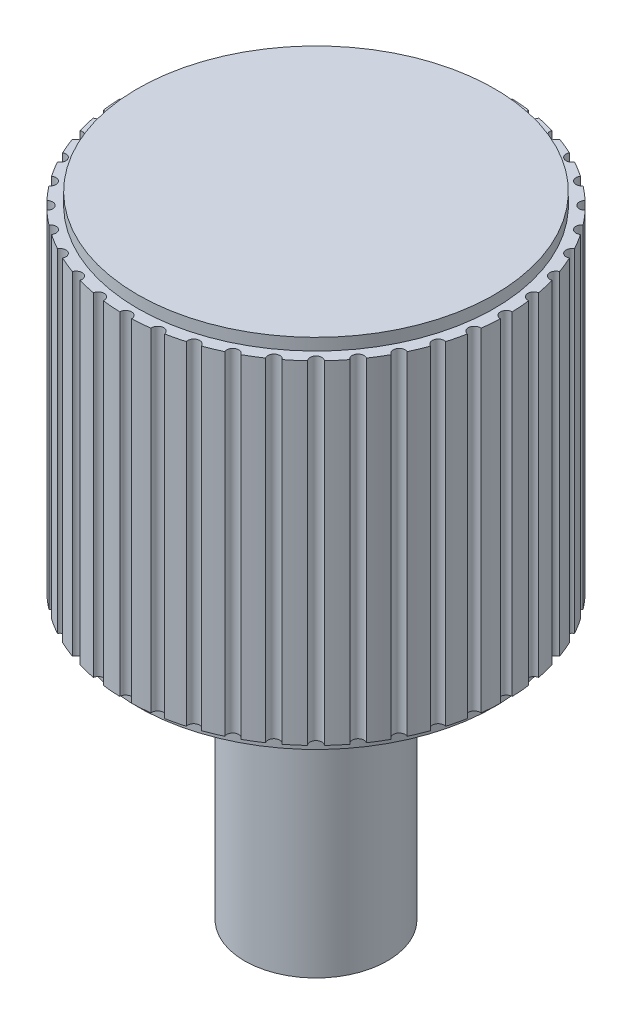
ISO-10303-21;
HEADER;
FILE_DESCRIPTION(('STEP AP214'),'2;1');
FILE_NAME('part.step','',(''),(''),'','','');
FILE_SCHEMA(('AUTOMOTIVE_DESIGN { 1 0 10303 214 1 1 1 1 }'));
ENDSEC;
DATA;
#1=APPLICATION_CONTEXT('core data for automotive mechanical design processes');
#2=APPLICATION_PROTOCOL_DEFINITION('international standard','automotive_design',2000,#1);
#3=PRODUCT_CONTEXT('',#1,'mechanical');
#4=PRODUCT('Part','Part','',(#3));
#5=PRODUCT_RELATED_PRODUCT_CATEGORY('part','',(#4));
#6=PRODUCT_DEFINITION_FORMATION('','',#4);
#7=PRODUCT_DEFINITION_CONTEXT('part definition',#1,'design');
#8=PRODUCT_DEFINITION('design','',#6,#7);
#9=PRODUCT_DEFINITION_SHAPE('','',#8);
#10=(LENGTH_UNIT() NAMED_UNIT(*) SI_UNIT(.MILLI.,.METRE.));
#11=(NAMED_UNIT(*) PLANE_ANGLE_UNIT() SI_UNIT($,.RADIAN.));
#12=(NAMED_UNIT(*) SI_UNIT($,.STERADIAN.) SOLID_ANGLE_UNIT());
#13=UNCERTAINTY_MEASURE_WITH_UNIT(LENGTH_MEASURE(1.E-05),#10,'distance_accuracy_value','');
#14=(GEOMETRIC_REPRESENTATION_CONTEXT(3) GLOBAL_UNCERTAINTY_ASSIGNED_CONTEXT((#13)) GLOBAL_UNIT_ASSIGNED_CONTEXT((#10,
#11,#12)) REPRESENTATION_CONTEXT('',''));
#15=CARTESIAN_POINT('',(0.,0.,0.));
#16=DIRECTION('',(0.,0.,1.));
#17=DIRECTION('',(1.,0.,0.));
#18=AXIS2_PLACEMENT_3D('',#15,#16,#17);
#19=CARTESIAN_POINT('',(0.,2.91633889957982,0.));
#20=DIRECTION('',(0.,1.,0.));
#21=DIRECTION('',(0.,0.,1.));
#22=AXIS2_PLACEMENT_3D('',#19,#20,#21);
#23=CYLINDRICAL_SURFACE('',#22,1.6);
#24=DIRECTION('',(0.,1.,0.));
#25=VECTOR('',#24,1.);
#26=CARTESIAN_POINT('',(0.200794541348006,2.65,-1.58735048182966));
#27=LINE('',#26,#25);
#28=CARTESIAN_POINT('',(0.200794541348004,2.4,-1.58735048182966));
#29=VERTEX_POINT('',#28);
#30=CARTESIAN_POINT('',(0.200794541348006,5.2,-1.58735048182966));
#31=VERTEX_POINT('',#30);
#32=EDGE_CURVE('E1036',#29,#31,#27,.T.);
#33=ORIENTED_EDGE('',*,*,#32,.F.);
#34=CARTESIAN_POINT('',(0.,2.4,0.));
#35=DIRECTION('',(0.,-1.,0.));
#36=DIRECTION('',(0.,0.,-1.));
#37=AXIS2_PLACEMENT_3D('',#34,#35,#36);
#38=CIRCLE('',#37,1.6);
#39=CARTESIAN_POINT('',(0.0499938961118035,2.4,-1.59921875));
#40=VERTEX_POINT('',#39);
#41=EDGE_CURVE('E557',#40,#29,#38,.T.);
#42=ORIENTED_EDGE('',*,*,#41,.F.);
#43=DIRECTION('',(0.,1.,0.));
#44=VECTOR('',#43,1.);
#45=CARTESIAN_POINT('',(0.0499938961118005,2.65,-1.59921875));
#46=LINE('',#45,#44);
#47=CARTESIAN_POINT('',(0.0499938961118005,5.2,-1.59921875));
#48=VERTEX_POINT('',#47);
#49=EDGE_CURVE('E1040',#48,#40,#46,.F.);
#50=ORIENTED_EDGE('',*,*,#49,.F.);
#51=CARTESIAN_POINT('',(0.,5.2,0.));
#52=DIRECTION('',(0.,1.,0.));
#53=DIRECTION('',(0.,0.,1.));
#54=AXIS2_PLACEMENT_3D('',#51,#52,#53);
#55=CIRCLE('',#54,1.6);
#56=EDGE_CURVE('E568',#31,#48,#55,.T.);
#57=ORIENTED_EDGE('',*,*,#56,.F.);
#58=EDGE_LOOP('',(#33,#42,#50,#57));
#59=FACE_BOUND('',#58,.T.);
#60=ADVANCED_FACE('F35',(#59),#23,.T.);
#61=DIRECTION('',(0.,1.,0.));
#62=VECTOR('',#61,1.);
#63=CARTESIAN_POINT('',(0.299551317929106,2.65,-1.5717089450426));
#64=LINE('',#63,#62);
#65=CARTESIAN_POINT('',(0.299551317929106,5.2,-1.5717089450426));
#66=VERTEX_POINT('',#65);
#67=CARTESIAN_POINT('',(0.299551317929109,2.4,-1.5717089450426));
#68=VERTEX_POINT('',#67);
#69=EDGE_CURVE('E1034',#66,#68,#64,.F.);
#70=ORIENTED_EDGE('',*,*,#69,.F.);
#71=CARTESIAN_POINT('',(0.446638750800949,5.2,-1.53639637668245));
#72=VERTEX_POINT('',#71);
#73=EDGE_CURVE('E669',#72,#66,#55,.T.);
#74=ORIENTED_EDGE('',*,*,#73,.F.);
#75=DIRECTION('',(0.,1.,0.));
#76=VECTOR('',#75,1.);
#77=CARTESIAN_POINT('',(0.446638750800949,2.65,-1.53639637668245));
#78=LINE('',#77,#76);
#79=CARTESIAN_POINT('',(0.446638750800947,2.4,-1.53639637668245));
#80=VERTEX_POINT('',#79);
#81=EDGE_CURVE('E656',#80,#72,#78,.T.);
#82=ORIENTED_EDGE('',*,*,#81,.F.);
#83=EDGE_CURVE('E562',#68,#80,#38,.T.);
#84=ORIENTED_EDGE('',*,*,#83,.F.);
#85=EDGE_LOOP('',(#70,#74,#82,#84));
#86=FACE_BOUND('',#85,.T.);
#87=ADVANCED_FACE('F667',(#86),#23,.T.);
#88=DIRECTION('',(0.,1.,0.));
#89=VECTOR('',#88,1.);
#90=CARTESIAN_POINT('',(0.541732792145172,2.65,-1.50549844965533));
#91=LINE('',#90,#89);
#92=CARTESIAN_POINT('',(0.541732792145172,5.2,-1.50549844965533));
#93=VERTEX_POINT('',#92);
#94=CARTESIAN_POINT('',(0.541732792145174,2.4,-1.50549844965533));
#95=VERTEX_POINT('',#94);
#96=EDGE_CURVE('E659',#93,#95,#91,.F.);
#97=ORIENTED_EDGE('',*,*,#96,.F.);
#98=CARTESIAN_POINT('',(0.681485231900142,5.2,-1.44761109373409));
#99=VERTEX_POINT('',#98);
#100=EDGE_CURVE('E1103',#99,#93,#55,.T.);
#101=ORIENTED_EDGE('',*,*,#100,.F.);
#102=DIRECTION('',(0.,1.,0.));
#103=VECTOR('',#102,1.);
#104=CARTESIAN_POINT('',(0.681485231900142,2.65,-1.44761109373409));
#105=LINE('',#104,#103);
#106=CARTESIAN_POINT('',(0.681485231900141,2.4,-1.44761109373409));
#107=VERTEX_POINT('',#106);
#108=EDGE_CURVE('E1028',#107,#99,#105,.T.);
#109=ORIENTED_EDGE('',*,*,#108,.F.);
#110=EDGE_CURVE('E672',#95,#107,#38,.T.);
#111=ORIENTED_EDGE('',*,*,#110,.F.);
#112=EDGE_LOOP('',(#97,#101,#109,#111));
#113=FACE_BOUND('',#112,.T.);
#114=ADVANCED_FACE('F1073',(#113),#23,.T.);
#115=DIRECTION('',(0.,1.,0.));
#116=VECTOR('',#115,1.);
#117=CARTESIAN_POINT('',(0.770575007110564,2.65,-1.40221758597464));
#118=LINE('',#117,#116);
#119=CARTESIAN_POINT('',(0.770575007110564,5.2,-1.40221758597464));
#120=VERTEX_POINT('',#119);
#121=CARTESIAN_POINT('',(0.770575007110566,2.4,-1.40221758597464));
#122=VERTEX_POINT('',#121);
#123=EDGE_CURVE('E1026',#120,#122,#118,.F.);
#124=ORIENTED_EDGE('',*,*,#123,.F.);
#125=CARTESIAN_POINT('',(0.89955128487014,5.2,-1.32318082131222));
#126=VERTEX_POINT('',#125);
#127=EDGE_CURVE('E1104',#126,#120,#55,.T.);
#128=ORIENTED_EDGE('',*,*,#127,.F.);
#129=DIRECTION('',(0.,1.,0.));
#130=VECTOR('',#129,1.);
#131=CARTESIAN_POINT('',(0.89955128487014,2.65,-1.32318082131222));
#132=LINE('',#131,#130);
#133=CARTESIAN_POINT('',(0.899551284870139,2.4,-1.32318082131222));
#134=VERTEX_POINT('',#133);
#135=EDGE_CURVE('E1022',#134,#126,#132,.T.);
#136=ORIENTED_EDGE('',*,*,#135,.F.);
#137=EDGE_CURVE('E673',#122,#134,#38,.T.);
#138=ORIENTED_EDGE('',*,*,#137,.F.);
#139=EDGE_LOOP('',(#124,#128,#136,#138));
#140=FACE_BOUND('',#139,.T.);
#141=ADVANCED_FACE('F1595',(#140),#23,.T.);
#142=DIRECTION('',(0.,1.,0.));
#143=VECTOR('',#142,1.);
#144=CARTESIAN_POINT('',(0.980443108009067,2.65,-1.2644094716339));
#145=LINE('',#144,#143);
#146=CARTESIAN_POINT('',(0.980443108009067,5.2,-1.2644094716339));
#147=VERTEX_POINT('',#146);
#148=CARTESIAN_POINT('',(0.980443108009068,2.4,-1.2644094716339));
#149=VERTEX_POINT('',#148);
#150=EDGE_CURVE('E1020',#147,#149,#145,.F.);
#151=ORIENTED_EDGE('',*,*,#150,.F.);
#152=CARTESIAN_POINT('',(1.09546739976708,5.2,-1.16616944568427));
#153=VERTEX_POINT('',#152);
#154=EDGE_CURVE('E1108',#153,#147,#55,.T.);
#155=ORIENTED_EDGE('',*,*,#154,.F.);
#156=DIRECTION('',(0.,1.,0.));
#157=VECTOR('',#156,1.);
#158=CARTESIAN_POINT('',(1.09546739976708,2.65,-1.16616944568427));
#159=LINE('',#158,#157);
#160=CARTESIAN_POINT('',(1.09546739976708,2.4,-1.16616944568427));
#161=VERTEX_POINT('',#160);
#162=EDGE_CURVE('E1016',#161,#153,#159,.T.);
#163=ORIENTED_EDGE('',*,*,#162,.F.);
#164=EDGE_CURVE('E676',#149,#161,#38,.T.);
#165=ORIENTED_EDGE('',*,*,#164,.F.);
#166=EDGE_LOOP('',(#151,#155,#163,#165));
#167=FACE_BOUND('',#166,.T.);
#168=ADVANCED_FACE('F1587',(#167),#23,.T.);
#169=DIRECTION('',(0.,1.,0.));
#170=VECTOR('',#169,1.);
#171=CARTESIAN_POINT('',(1.16616944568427,2.65,-1.09546739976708));
#172=LINE('',#171,#170);
#173=CARTESIAN_POINT('',(1.16616944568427,5.2,-1.09546739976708));
#174=VERTEX_POINT('',#173);
#175=CARTESIAN_POINT('',(1.16616944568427,2.4,-1.09546739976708));
#176=VERTEX_POINT('',#175);
#177=EDGE_CURVE('E1014',#174,#176,#172,.F.);
#178=ORIENTED_EDGE('',*,*,#177,.F.);
#179=CARTESIAN_POINT('',(1.2644094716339,5.2,-0.980443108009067));
#180=VERTEX_POINT('',#179);
#181=EDGE_CURVE('E1112',#180,#174,#55,.T.);
#182=ORIENTED_EDGE('',*,*,#181,.F.);
#183=DIRECTION('',(0.,1.,0.));
#184=VECTOR('',#183,1.);
#185=CARTESIAN_POINT('',(1.2644094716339,2.65,-0.980443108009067));
#186=LINE('',#185,#184);
#187=CARTESIAN_POINT('',(1.2644094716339,2.4,-0.980443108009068));
#188=VERTEX_POINT('',#187);
#189=EDGE_CURVE('E1010',#188,#180,#186,.T.);
#190=ORIENTED_EDGE('',*,*,#189,.F.);
#191=EDGE_CURVE('E680',#176,#188,#38,.T.);
#192=ORIENTED_EDGE('',*,*,#191,.F.);
#193=EDGE_LOOP('',(#178,#182,#190,#192));
#194=FACE_BOUND('',#193,.T.);
#195=ADVANCED_FACE('F1579',(#194),#23,.T.);
#196=DIRECTION('',(0.,1.,0.));
#197=VECTOR('',#196,1.);
#198=CARTESIAN_POINT('',(1.32318082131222,2.65,-0.899551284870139));
#199=LINE('',#198,#197);
#200=CARTESIAN_POINT('',(1.32318082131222,5.2,-0.899551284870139));
#201=VERTEX_POINT('',#200);
#202=CARTESIAN_POINT('',(1.32318082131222,2.4,-0.899551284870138));
#203=VERTEX_POINT('',#202);
#204=EDGE_CURVE('E1008',#201,#203,#199,.F.);
#205=ORIENTED_EDGE('',*,*,#204,.F.);
#206=CARTESIAN_POINT('',(1.40221758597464,5.2,-0.770575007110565));
#207=VERTEX_POINT('',#206);
#208=EDGE_CURVE('E1116',#207,#201,#55,.T.);
#209=ORIENTED_EDGE('',*,*,#208,.F.);
#210=DIRECTION('',(0.,1.,0.));
#211=VECTOR('',#210,1.);
#212=CARTESIAN_POINT('',(1.40221758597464,2.65,-0.770575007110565));
#213=LINE('',#212,#211);
#214=CARTESIAN_POINT('',(1.40221758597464,2.4,-0.770575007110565));
#215=VERTEX_POINT('',#214);
#216=EDGE_CURVE('E1004',#215,#207,#213,.T.);
#217=ORIENTED_EDGE('',*,*,#216,.F.);
#218=EDGE_CURVE('E684',#203,#215,#38,.T.);
#219=ORIENTED_EDGE('',*,*,#218,.F.);
#220=EDGE_LOOP('',(#205,#209,#217,#219));
#221=FACE_BOUND('',#220,.T.);
#222=ADVANCED_FACE('F1571',(#221),#23,.T.);
#223=DIRECTION('',(0.,1.,0.));
#224=VECTOR('',#223,1.);
#225=CARTESIAN_POINT('',(1.44761109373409,2.65,-0.681485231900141));
#226=LINE('',#225,#224);
#227=CARTESIAN_POINT('',(1.44761109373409,5.2,-0.681485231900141));
#228=VERTEX_POINT('',#227);
#229=CARTESIAN_POINT('',(1.44761109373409,2.4,-0.681485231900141));
#230=VERTEX_POINT('',#229);
#231=EDGE_CURVE('E1002',#228,#230,#226,.F.);
#232=ORIENTED_EDGE('',*,*,#231,.F.);
#233=CARTESIAN_POINT('',(1.50549844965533,5.2,-0.541732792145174));
#234=VERTEX_POINT('',#233);
#235=EDGE_CURVE('E1120',#234,#228,#55,.T.);
#236=ORIENTED_EDGE('',*,*,#235,.F.);
#237=DIRECTION('',(0.,1.,0.));
#238=VECTOR('',#237,1.);
#239=CARTESIAN_POINT('',(1.50549844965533,2.65,-0.541732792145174));
#240=LINE('',#239,#238);
#241=CARTESIAN_POINT('',(1.50549844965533,2.4,-0.541732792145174));
#242=VERTEX_POINT('',#241);
#243=EDGE_CURVE('E998',#242,#234,#240,.T.);
#244=ORIENTED_EDGE('',*,*,#243,.F.);
#245=EDGE_CURVE('E688',#230,#242,#38,.T.);
#246=ORIENTED_EDGE('',*,*,#245,.F.);
#247=EDGE_LOOP('',(#232,#236,#244,#246));
#248=FACE_BOUND('',#247,.T.);
#249=ADVANCED_FACE('F1563',(#248),#23,.T.);
#250=DIRECTION('',(0.,1.,0.));
#251=VECTOR('',#250,1.);
#252=CARTESIAN_POINT('',(1.53639637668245,2.65,-0.446638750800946));
#253=LINE('',#252,#251);
#254=CARTESIAN_POINT('',(1.53639637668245,5.2,-0.446638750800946));
#255=VERTEX_POINT('',#254);
#256=CARTESIAN_POINT('',(1.53639637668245,2.4,-0.446638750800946));
#257=VERTEX_POINT('',#256);
#258=EDGE_CURVE('E996',#255,#257,#253,.F.);
#259=ORIENTED_EDGE('',*,*,#258,.F.);
#260=CARTESIAN_POINT('',(1.5717089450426,5.2,-0.29955131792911));
#261=VERTEX_POINT('',#260);
#262=EDGE_CURVE('E1124',#261,#255,#55,.T.);
#263=ORIENTED_EDGE('',*,*,#262,.F.);
#264=DIRECTION('',(0.,1.,0.));
#265=VECTOR('',#264,1.);
#266=CARTESIAN_POINT('',(1.5717089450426,2.65,-0.29955131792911));
#267=LINE('',#266,#265);
#268=CARTESIAN_POINT('',(1.5717089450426,2.4,-0.299551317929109));
#269=VERTEX_POINT('',#268);
#270=EDGE_CURVE('E992',#269,#261,#267,.T.);
#271=ORIENTED_EDGE('',*,*,#270,.F.);
#272=EDGE_CURVE('E692',#257,#269,#38,.T.);
#273=ORIENTED_EDGE('',*,*,#272,.F.);
#274=EDGE_LOOP('',(#259,#263,#271,#273));
#275=FACE_BOUND('',#274,.T.);
#276=ADVANCED_FACE('F1555',(#275),#23,.T.);
#277=DIRECTION('',(0.,1.,0.));
#278=VECTOR('',#277,1.);
#279=CARTESIAN_POINT('',(1.58735048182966,2.65,-0.200794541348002));
#280=LINE('',#279,#278);
#281=CARTESIAN_POINT('',(1.58735048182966,5.2,-0.200794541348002));
#282=VERTEX_POINT('',#281);
#283=CARTESIAN_POINT('',(1.58735048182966,2.4,-0.200794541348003));
#284=VERTEX_POINT('',#283);
#285=EDGE_CURVE('E990',#282,#284,#280,.F.);
#286=ORIENTED_EDGE('',*,*,#285,.F.);
#287=CARTESIAN_POINT('',(1.59921875,5.2,-0.0499938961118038));
#288=VERTEX_POINT('',#287);
#289=EDGE_CURVE('E1128',#288,#282,#55,.T.);
#290=ORIENTED_EDGE('',*,*,#289,.F.);
#291=DIRECTION('',(0.,1.,0.));
#292=VECTOR('',#291,1.);
#293=CARTESIAN_POINT('',(1.59921875,2.65,-0.0499938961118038));
#294=LINE('',#293,#292);
#295=CARTESIAN_POINT('',(1.59921875,2.4,-0.0499938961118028));
#296=VERTEX_POINT('',#295);
#297=EDGE_CURVE('E986',#296,#288,#294,.T.);
#298=ORIENTED_EDGE('',*,*,#297,.F.);
#299=EDGE_CURVE('E696',#284,#296,#38,.T.);
#300=ORIENTED_EDGE('',*,*,#299,.F.);
#301=EDGE_LOOP('',(#286,#290,#298,#300));
#302=FACE_BOUND('',#301,.T.);
#303=ADVANCED_FACE('F1547',(#302),#23,.T.);
#304=DIRECTION('',(0.,1.,0.));
#305=VECTOR('',#304,1.);
#306=CARTESIAN_POINT('',(1.59921875,2.65,0.0499938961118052));
#307=LINE('',#306,#305);
#308=CARTESIAN_POINT('',(1.59921875,5.2,0.0499938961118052));
#309=VERTEX_POINT('',#308);
#310=CARTESIAN_POINT('',(1.59921875,2.4,0.0499938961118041));
#311=VERTEX_POINT('',#310);
#312=EDGE_CURVE('E984',#309,#311,#307,.F.);
#313=ORIENTED_EDGE('',*,*,#312,.F.);
#314=CARTESIAN_POINT('',(1.58735048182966,5.2,0.200794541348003));
#315=VERTEX_POINT('',#314);
#316=EDGE_CURVE('E1132',#315,#309,#55,.T.);
#317=ORIENTED_EDGE('',*,*,#316,.F.);
#318=DIRECTION('',(0.,1.,0.));
#319=VECTOR('',#318,1.);
#320=CARTESIAN_POINT('',(1.58735048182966,2.65,0.200794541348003));
#321=LINE('',#320,#319);
#322=CARTESIAN_POINT('',(1.58735048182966,2.4,0.200794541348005));
#323=VERTEX_POINT('',#322);
#324=EDGE_CURVE('E980',#323,#315,#321,.T.);
#325=ORIENTED_EDGE('',*,*,#324,.F.);
#326=EDGE_CURVE('E700',#311,#323,#38,.T.);
#327=ORIENTED_EDGE('',*,*,#326,.F.);
#328=EDGE_LOOP('',(#313,#317,#325,#327));
#329=FACE_BOUND('',#328,.T.);
#330=ADVANCED_FACE('F1539',(#329),#23,.T.);
#331=DIRECTION('',(0.,1.,0.));
#332=VECTOR('',#331,1.);
#333=CARTESIAN_POINT('',(1.5717089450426,2.65,0.299551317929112));
#334=LINE('',#333,#332);
#335=CARTESIAN_POINT('',(1.5717089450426,5.2,0.299551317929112));
#336=VERTEX_POINT('',#335);
#337=CARTESIAN_POINT('',(1.5717089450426,2.4,0.29955131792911));
#338=VERTEX_POINT('',#337);
#339=EDGE_CURVE('E978',#336,#338,#334,.F.);
#340=ORIENTED_EDGE('',*,*,#339,.F.);
#341=CARTESIAN_POINT('',(1.53639637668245,5.2,0.446638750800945));
#342=VERTEX_POINT('',#341);
#343=EDGE_CURVE('E1136',#342,#336,#55,.T.);
#344=ORIENTED_EDGE('',*,*,#343,.F.);
#345=DIRECTION('',(0.,1.,0.));
#346=VECTOR('',#345,1.);
#347=CARTESIAN_POINT('',(1.53639637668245,2.65,0.446638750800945));
#348=LINE('',#347,#346);
#349=CARTESIAN_POINT('',(1.53639637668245,2.4,0.446638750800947));
#350=VERTEX_POINT('',#349);
#351=EDGE_CURVE('E974',#350,#342,#348,.T.);
#352=ORIENTED_EDGE('',*,*,#351,.F.);
#353=EDGE_CURVE('E704',#338,#350,#38,.T.);
#354=ORIENTED_EDGE('',*,*,#353,.F.);
#355=EDGE_LOOP('',(#340,#344,#352,#354));
#356=FACE_BOUND('',#355,.T.);
#357=ADVANCED_FACE('F1531',(#356),#23,.T.);
#358=DIRECTION('',(0.,1.,0.));
#359=VECTOR('',#358,1.);
#360=CARTESIAN_POINT('',(1.50549844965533,2.65,0.541732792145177));
#361=LINE('',#360,#359);
#362=CARTESIAN_POINT('',(1.50549844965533,5.2,0.541732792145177));
#363=VERTEX_POINT('',#362);
#364=CARTESIAN_POINT('',(1.50549844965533,2.4,0.541732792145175));
#365=VERTEX_POINT('',#364);
#366=EDGE_CURVE('E972',#363,#365,#361,.F.);
#367=ORIENTED_EDGE('',*,*,#366,.F.);
#368=CARTESIAN_POINT('',(1.44761109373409,5.2,0.681485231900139));
#369=VERTEX_POINT('',#368);
#370=EDGE_CURVE('E1140',#369,#363,#55,.T.);
#371=ORIENTED_EDGE('',*,*,#370,.F.);
#372=DIRECTION('',(0.,1.,0.));
#373=VECTOR('',#372,1.);
#374=CARTESIAN_POINT('',(1.44761109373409,2.65,0.681485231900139));
#375=LINE('',#374,#373);
#376=CARTESIAN_POINT('',(1.44761109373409,2.4,0.681485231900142));
#377=VERTEX_POINT('',#376);
#378=EDGE_CURVE('E968',#377,#369,#375,.T.);
#379=ORIENTED_EDGE('',*,*,#378,.F.);
#380=EDGE_CURVE('E708',#365,#377,#38,.T.);
#381=ORIENTED_EDGE('',*,*,#380,.F.);
#382=EDGE_LOOP('',(#367,#371,#379,#381));
#383=FACE_BOUND('',#382,.T.);
#384=ADVANCED_FACE('F1523',(#383),#23,.T.);
#385=DIRECTION('',(0.,1.,0.));
#386=VECTOR('',#385,1.);
#387=CARTESIAN_POINT('',(1.40221758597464,2.65,0.770575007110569));
#388=LINE('',#387,#386);
#389=CARTESIAN_POINT('',(1.40221758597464,5.2,0.770575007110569));
#390=VERTEX_POINT('',#389);
#391=CARTESIAN_POINT('',(1.40221758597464,2.4,0.770575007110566));
#392=VERTEX_POINT('',#391);
#393=EDGE_CURVE('E966',#390,#392,#388,.F.);
#394=ORIENTED_EDGE('',*,*,#393,.F.);
#395=CARTESIAN_POINT('',(1.32318082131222,5.2,0.899551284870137));
#396=VERTEX_POINT('',#395);
#397=EDGE_CURVE('E1144',#396,#390,#55,.T.);
#398=ORIENTED_EDGE('',*,*,#397,.F.);
#399=DIRECTION('',(0.,1.,0.));
#400=VECTOR('',#399,1.);
#401=CARTESIAN_POINT('',(1.32318082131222,2.65,0.899551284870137));
#402=LINE('',#401,#400);
#403=CARTESIAN_POINT('',(1.32318082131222,2.4,0.89955128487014));
#404=VERTEX_POINT('',#403);
#405=EDGE_CURVE('E962',#404,#396,#402,.T.);
#406=ORIENTED_EDGE('',*,*,#405,.F.);
#407=EDGE_CURVE('E712',#392,#404,#38,.T.);
#408=ORIENTED_EDGE('',*,*,#407,.F.);
#409=EDGE_LOOP('',(#394,#398,#406,#408));
#410=FACE_BOUND('',#409,.T.);
#411=ADVANCED_FACE('F1515',(#410),#23,.T.);
#412=DIRECTION('',(0.,1.,0.));
#413=VECTOR('',#412,1.);
#414=CARTESIAN_POINT('',(1.2644094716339,2.65,0.980443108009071));
#415=LINE('',#414,#413);
#416=CARTESIAN_POINT('',(1.2644094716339,5.2,0.980443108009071));
#417=VERTEX_POINT('',#416);
#418=CARTESIAN_POINT('',(1.2644094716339,2.4,0.980443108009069));
#419=VERTEX_POINT('',#418);
#420=EDGE_CURVE('E960',#417,#419,#415,.F.);
#421=ORIENTED_EDGE('',*,*,#420,.F.);
#422=CARTESIAN_POINT('',(1.16616944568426,5.2,1.09546739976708));
#423=VERTEX_POINT('',#422);
#424=EDGE_CURVE('E1148',#423,#417,#55,.T.);
#425=ORIENTED_EDGE('',*,*,#424,.F.);
#426=DIRECTION('',(0.,1.,0.));
#427=VECTOR('',#426,1.);
#428=CARTESIAN_POINT('',(1.16616944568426,2.65,1.09546739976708));
#429=LINE('',#428,#427);
#430=CARTESIAN_POINT('',(1.16616944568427,2.4,1.09546739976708));
#431=VERTEX_POINT('',#430);
#432=EDGE_CURVE('E956',#431,#423,#429,.T.);
#433=ORIENTED_EDGE('',*,*,#432,.F.);
#434=EDGE_CURVE('E716',#419,#431,#38,.T.);
#435=ORIENTED_EDGE('',*,*,#434,.F.);
#436=EDGE_LOOP('',(#421,#425,#433,#435));
#437=FACE_BOUND('',#436,.T.);
#438=ADVANCED_FACE('F1507',(#437),#23,.T.);
#439=DIRECTION('',(0.,1.,0.));
#440=VECTOR('',#439,1.);
#441=CARTESIAN_POINT('',(1.09546739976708,2.65,1.16616944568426));
#442=LINE('',#441,#440);
#443=CARTESIAN_POINT('',(1.09546739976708,5.2,1.16616944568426));
#444=VERTEX_POINT('',#443);
#445=CARTESIAN_POINT('',(1.09546739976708,2.4,1.16616944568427));
#446=VERTEX_POINT('',#445);
#447=EDGE_CURVE('E954',#444,#446,#442,.F.);
#448=ORIENTED_EDGE('',*,*,#447,.F.);
#449=CARTESIAN_POINT('',(0.980443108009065,5.2,1.2644094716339));
#450=VERTEX_POINT('',#449);
#451=EDGE_CURVE('E1152',#450,#444,#55,.T.);
#452=ORIENTED_EDGE('',*,*,#451,.F.);
#453=DIRECTION('',(0.,1.,0.));
#454=VECTOR('',#453,1.);
#455=CARTESIAN_POINT('',(0.980443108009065,2.65,1.2644094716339));
#456=LINE('',#455,#454);
#457=CARTESIAN_POINT('',(0.980443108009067,2.4,1.2644094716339));
#458=VERTEX_POINT('',#457);
#459=EDGE_CURVE('E950',#458,#450,#456,.T.);
#460=ORIENTED_EDGE('',*,*,#459,.F.);
#461=EDGE_CURVE('E720',#446,#458,#38,.T.);
#462=ORIENTED_EDGE('',*,*,#461,.F.);
#463=EDGE_LOOP('',(#448,#452,#460,#462));
#464=FACE_BOUND('',#463,.T.);
#465=ADVANCED_FACE('F1499',(#464),#23,.T.);
#466=DIRECTION('',(0.,1.,0.));
#467=VECTOR('',#466,1.);
#468=CARTESIAN_POINT('',(0.89955128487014,2.65,1.32318082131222));
#469=LINE('',#468,#467);
#470=CARTESIAN_POINT('',(0.89955128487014,5.2,1.32318082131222));
#471=VERTEX_POINT('',#470);
#472=CARTESIAN_POINT('',(0.899551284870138,2.4,1.32318082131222));
#473=VERTEX_POINT('',#472);
#474=EDGE_CURVE('E948',#471,#473,#469,.F.);
#475=ORIENTED_EDGE('',*,*,#474,.F.);
#476=CARTESIAN_POINT('',(0.770575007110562,5.2,1.40221758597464));
#477=VERTEX_POINT('',#476);
#478=EDGE_CURVE('E1156',#477,#471,#55,.T.);
#479=ORIENTED_EDGE('',*,*,#478,.F.);
#480=DIRECTION('',(0.,1.,0.));
#481=VECTOR('',#480,1.);
#482=CARTESIAN_POINT('',(0.770575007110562,2.65,1.40221758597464));
#483=LINE('',#482,#481);
#484=CARTESIAN_POINT('',(0.770575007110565,2.4,1.40221758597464));
#485=VERTEX_POINT('',#484);
#486=EDGE_CURVE('E944',#485,#477,#483,.T.);
#487=ORIENTED_EDGE('',*,*,#486,.F.);
#488=EDGE_CURVE('E724',#473,#485,#38,.T.);
#489=ORIENTED_EDGE('',*,*,#488,.F.);
#490=EDGE_LOOP('',(#475,#479,#487,#489));
#491=FACE_BOUND('',#490,.T.);
#492=ADVANCED_FACE('F1491',(#491),#23,.T.);
#493=DIRECTION('',(0.,1.,0.));
#494=VECTOR('',#493,1.);
#495=CARTESIAN_POINT('',(0.681485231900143,2.65,1.44761109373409));
#496=LINE('',#495,#494);
#497=CARTESIAN_POINT('',(0.681485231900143,5.2,1.44761109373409));
#498=VERTEX_POINT('',#497);
#499=CARTESIAN_POINT('',(0.68148523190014,2.4,1.44761109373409));
#500=VERTEX_POINT('',#499);
#501=EDGE_CURVE('E942',#498,#500,#496,.F.);
#502=ORIENTED_EDGE('',*,*,#501,.F.);
#503=CARTESIAN_POINT('',(0.54173279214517,5.2,1.50549844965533));
#504=VERTEX_POINT('',#503);
#505=EDGE_CURVE('E1160',#504,#498,#55,.T.);
#506=ORIENTED_EDGE('',*,*,#505,.F.);
#507=DIRECTION('',(0.,1.,0.));
#508=VECTOR('',#507,1.);
#509=CARTESIAN_POINT('',(0.54173279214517,2.65,1.50549844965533));
#510=LINE('',#509,#508);
#511=CARTESIAN_POINT('',(0.541732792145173,2.4,1.50549844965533));
#512=VERTEX_POINT('',#511);
#513=EDGE_CURVE('E938',#512,#504,#510,.T.);
#514=ORIENTED_EDGE('',*,*,#513,.F.);
#515=EDGE_CURVE('E728',#500,#512,#38,.T.);
#516=ORIENTED_EDGE('',*,*,#515,.F.);
#517=EDGE_LOOP('',(#502,#506,#514,#516));
#518=FACE_BOUND('',#517,.T.);
#519=ADVANCED_FACE('F1483',(#518),#23,.T.);
#520=DIRECTION('',(0.,1.,0.));
#521=VECTOR('',#520,1.);
#522=CARTESIAN_POINT('',(0.446638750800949,2.65,1.53639637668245));
#523=LINE('',#522,#521);
#524=CARTESIAN_POINT('',(0.446638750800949,5.2,1.53639637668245));
#525=VERTEX_POINT('',#524);
#526=CARTESIAN_POINT('',(0.446638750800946,2.4,1.53639637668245));
#527=VERTEX_POINT('',#526);
#528=EDGE_CURVE('E936',#525,#527,#523,.F.);
#529=ORIENTED_EDGE('',*,*,#528,.F.);
#530=CARTESIAN_POINT('',(0.299551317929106,5.2,1.5717089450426));
#531=VERTEX_POINT('',#530);
#532=EDGE_CURVE('E1164',#531,#525,#55,.T.);
#533=ORIENTED_EDGE('',*,*,#532,.F.);
#534=DIRECTION('',(0.,1.,0.));
#535=VECTOR('',#534,1.);
#536=CARTESIAN_POINT('',(0.299551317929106,2.65,1.5717089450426));
#537=LINE('',#536,#535);
#538=CARTESIAN_POINT('',(0.299551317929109,2.4,1.5717089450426));
#539=VERTEX_POINT('',#538);
#540=EDGE_CURVE('E932',#539,#531,#537,.T.);
#541=ORIENTED_EDGE('',*,*,#540,.F.);
#542=EDGE_CURVE('E732',#527,#539,#38,.T.);
#543=ORIENTED_EDGE('',*,*,#542,.F.);
#544=EDGE_LOOP('',(#529,#533,#541,#543));
#545=FACE_BOUND('',#544,.T.);
#546=ADVANCED_FACE('F1475',(#545),#23,.T.);
#547=DIRECTION('',(0.,1.,0.));
#548=VECTOR('',#547,1.);
#549=CARTESIAN_POINT('',(0.200794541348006,2.65,1.58735048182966));
#550=LINE('',#549,#548);
#551=CARTESIAN_POINT('',(0.200794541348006,5.2,1.58735048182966));
#552=VERTEX_POINT('',#551);
#553=CARTESIAN_POINT('',(0.200794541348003,2.4,1.58735048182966));
#554=VERTEX_POINT('',#553);
#555=EDGE_CURVE('E930',#552,#554,#550,.F.);
#556=ORIENTED_EDGE('',*,*,#555,.F.);
#557=CARTESIAN_POINT('',(0.0499938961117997,5.2,1.59921875));
#558=VERTEX_POINT('',#557);
#559=EDGE_CURVE('E1168',#558,#552,#55,.T.);
#560=ORIENTED_EDGE('',*,*,#559,.F.);
#561=DIRECTION('',(0.,1.,0.));
#562=VECTOR('',#561,1.);
#563=CARTESIAN_POINT('',(0.0499938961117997,2.65,1.59921875));
#564=LINE('',#563,#562);
#565=CARTESIAN_POINT('',(0.0499938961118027,2.4,1.59921875));
#566=VERTEX_POINT('',#565);
#567=EDGE_CURVE('E926',#566,#558,#564,.T.);
#568=ORIENTED_EDGE('',*,*,#567,.F.);
#569=EDGE_CURVE('E736',#554,#566,#38,.T.);
#570=ORIENTED_EDGE('',*,*,#569,.F.);
#571=EDGE_LOOP('',(#556,#560,#568,#570));
#572=FACE_BOUND('',#571,.T.);
#573=ADVANCED_FACE('F1467',(#572),#23,.T.);
#574=DIRECTION('',(0.,1.,0.));
#575=VECTOR('',#574,1.);
#576=CARTESIAN_POINT('',(-0.0499938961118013,2.65,1.59921875));
#577=LINE('',#576,#575);
#578=CARTESIAN_POINT('',(-0.0499938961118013,5.2,1.59921875));
#579=VERTEX_POINT('',#578);
#580=CARTESIAN_POINT('',(-0.0499938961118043,2.4,1.59921875));
#581=VERTEX_POINT('',#580);
#582=EDGE_CURVE('E924',#579,#581,#577,.F.);
#583=ORIENTED_EDGE('',*,*,#582,.F.);
#584=CARTESIAN_POINT('',(-0.200794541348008,5.2,1.58735048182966));
#585=VERTEX_POINT('',#584);
#586=EDGE_CURVE('E1172',#585,#579,#55,.T.);
#587=ORIENTED_EDGE('',*,*,#586,.F.);
#588=DIRECTION('',(0.,1.,0.));
#589=VECTOR('',#588,1.);
#590=CARTESIAN_POINT('',(-0.200794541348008,2.65,1.58735048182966));
#591=LINE('',#590,#589);
#592=CARTESIAN_POINT('',(-0.200794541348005,2.4,1.58735048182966));
#593=VERTEX_POINT('',#592);
#594=EDGE_CURVE('E920',#593,#585,#591,.T.);
#595=ORIENTED_EDGE('',*,*,#594,.F.);
#596=EDGE_CURVE('E740',#581,#593,#38,.T.);
#597=ORIENTED_EDGE('',*,*,#596,.F.);
#598=EDGE_LOOP('',(#583,#587,#595,#597));
#599=FACE_BOUND('',#598,.T.);
#600=ADVANCED_FACE('F1459',(#599),#23,.T.);
#601=DIRECTION('',(0.,1.,0.));
#602=VECTOR('',#601,1.);
#603=CARTESIAN_POINT('',(-0.299551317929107,2.65,1.5717089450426));
#604=LINE('',#603,#602);
#605=CARTESIAN_POINT('',(-0.299551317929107,5.2,1.5717089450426));
#606=VERTEX_POINT('',#605);
#607=CARTESIAN_POINT('',(-0.29955131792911,2.4,1.5717089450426));
#608=VERTEX_POINT('',#607);
#609=EDGE_CURVE('E918',#606,#608,#604,.F.);
#610=ORIENTED_EDGE('',*,*,#609,.F.);
#611=CARTESIAN_POINT('',(-0.44663875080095,5.2,1.53639637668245));
#612=VERTEX_POINT('',#611);
#613=EDGE_CURVE('E1176',#612,#606,#55,.T.);
#614=ORIENTED_EDGE('',*,*,#613,.F.);
#615=DIRECTION('',(0.,1.,0.));
#616=VECTOR('',#615,1.);
#617=CARTESIAN_POINT('',(-0.44663875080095,2.65,1.53639637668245));
#618=LINE('',#617,#616);
#619=CARTESIAN_POINT('',(-0.446638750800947,2.4,1.53639637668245));
#620=VERTEX_POINT('',#619);
#621=EDGE_CURVE('E914',#620,#612,#618,.T.);
#622=ORIENTED_EDGE('',*,*,#621,.F.);
#623=EDGE_CURVE('E744',#608,#620,#38,.T.);
#624=ORIENTED_EDGE('',*,*,#623,.F.);
#625=EDGE_LOOP('',(#610,#614,#622,#624));
#626=FACE_BOUND('',#625,.T.);
#627=ADVANCED_FACE('F1451',(#626),#23,.T.);
#628=DIRECTION('',(0.,1.,0.));
#629=VECTOR('',#628,1.);
#630=CARTESIAN_POINT('',(-0.541732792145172,2.65,1.50549844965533));
#631=LINE('',#630,#629);
#632=CARTESIAN_POINT('',(-0.541732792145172,5.2,1.50549844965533));
#633=VERTEX_POINT('',#632);
#634=CARTESIAN_POINT('',(-0.541732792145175,2.4,1.50549844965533));
#635=VERTEX_POINT('',#634);
#636=EDGE_CURVE('E912',#633,#635,#631,.F.);
#637=ORIENTED_EDGE('',*,*,#636,.F.);
#638=CARTESIAN_POINT('',(-0.681485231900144,5.2,1.44761109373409));
#639=VERTEX_POINT('',#638);
#640=EDGE_CURVE('E1180',#639,#633,#55,.T.);
#641=ORIENTED_EDGE('',*,*,#640,.F.);
#642=DIRECTION('',(0.,1.,0.));
#643=VECTOR('',#642,1.);
#644=CARTESIAN_POINT('',(-0.681485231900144,2.65,1.44761109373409));
#645=LINE('',#644,#643);
#646=CARTESIAN_POINT('',(-0.681485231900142,2.4,1.44761109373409));
#647=VERTEX_POINT('',#646);
#648=EDGE_CURVE('E908',#647,#639,#645,.T.);
#649=ORIENTED_EDGE('',*,*,#648,.F.);
#650=EDGE_CURVE('E748',#635,#647,#38,.T.);
#651=ORIENTED_EDGE('',*,*,#650,.F.);
#652=EDGE_LOOP('',(#637,#641,#649,#651));
#653=FACE_BOUND('',#652,.T.);
#654=ADVANCED_FACE('F1443',(#653),#23,.T.);
#655=DIRECTION('',(0.,1.,0.));
#656=VECTOR('',#655,1.);
#657=CARTESIAN_POINT('',(-0.770575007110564,2.65,1.40221758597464));
#658=LINE('',#657,#656);
#659=CARTESIAN_POINT('',(-0.770575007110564,5.2,1.40221758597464));
#660=VERTEX_POINT('',#659);
#661=CARTESIAN_POINT('',(-0.770575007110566,2.4,1.40221758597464));
#662=VERTEX_POINT('',#661);
#663=EDGE_CURVE('E906',#660,#662,#658,.F.);
#664=ORIENTED_EDGE('',*,*,#663,.F.);
#665=CARTESIAN_POINT('',(-0.899551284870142,5.2,1.32318082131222));
#666=VERTEX_POINT('',#665);
#667=EDGE_CURVE('E1184',#666,#660,#55,.T.);
#668=ORIENTED_EDGE('',*,*,#667,.F.);
#669=DIRECTION('',(0.,1.,0.));
#670=VECTOR('',#669,1.);
#671=CARTESIAN_POINT('',(-0.899551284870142,2.65,1.32318082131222));
#672=LINE('',#671,#670);
#673=CARTESIAN_POINT('',(-0.899551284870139,2.4,1.32318082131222));
#674=VERTEX_POINT('',#673);
#675=EDGE_CURVE('E902',#674,#666,#672,.T.);
#676=ORIENTED_EDGE('',*,*,#675,.F.);
#677=EDGE_CURVE('E752',#662,#674,#38,.T.);
#678=ORIENTED_EDGE('',*,*,#677,.F.);
#679=EDGE_LOOP('',(#664,#668,#676,#678));
#680=FACE_BOUND('',#679,.T.);
#681=ADVANCED_FACE('F1435',(#680),#23,.T.);
#682=DIRECTION('',(0.,1.,0.));
#683=VECTOR('',#682,1.);
#684=CARTESIAN_POINT('',(-0.980443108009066,2.65,1.2644094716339));
#685=LINE('',#684,#683);
#686=CARTESIAN_POINT('',(-0.980443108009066,5.2,1.2644094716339));
#687=VERTEX_POINT('',#686);
#688=CARTESIAN_POINT('',(-0.980443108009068,2.4,1.2644094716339));
#689=VERTEX_POINT('',#688);
#690=EDGE_CURVE('E900',#687,#689,#685,.F.);
#691=ORIENTED_EDGE('',*,*,#690,.F.);
#692=CARTESIAN_POINT('',(-1.09546739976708,5.2,1.16616944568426));
#693=VERTEX_POINT('',#692);
#694=EDGE_CURVE('E1188',#693,#687,#55,.T.);
#695=ORIENTED_EDGE('',*,*,#694,.F.);
#696=DIRECTION('',(0.,1.,0.));
#697=VECTOR('',#696,1.);
#698=CARTESIAN_POINT('',(-1.09546739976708,2.65,1.16616944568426));
#699=LINE('',#698,#697);
#700=CARTESIAN_POINT('',(-1.09546739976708,2.4,1.16616944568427));
#701=VERTEX_POINT('',#700);
#702=EDGE_CURVE('E896',#701,#693,#699,.T.);
#703=ORIENTED_EDGE('',*,*,#702,.F.);
#704=EDGE_CURVE('E756',#689,#701,#38,.T.);
#705=ORIENTED_EDGE('',*,*,#704,.F.);
#706=EDGE_LOOP('',(#691,#695,#703,#705));
#707=FACE_BOUND('',#706,.T.);
#708=ADVANCED_FACE('F1427',(#707),#23,.T.);
#709=DIRECTION('',(0.,1.,0.));
#710=VECTOR('',#709,1.);
#711=CARTESIAN_POINT('',(-1.16616944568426,2.65,1.09546739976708));
#712=LINE('',#711,#710);
#713=CARTESIAN_POINT('',(-1.16616944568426,5.2,1.09546739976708));
#714=VERTEX_POINT('',#713);
#715=CARTESIAN_POINT('',(-1.16616944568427,2.4,1.09546739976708));
#716=VERTEX_POINT('',#715);
#717=EDGE_CURVE('E894',#714,#716,#712,.F.);
#718=ORIENTED_EDGE('',*,*,#717,.F.);
#719=CARTESIAN_POINT('',(-1.2644094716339,5.2,0.980443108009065));
#720=VERTEX_POINT('',#719);
#721=EDGE_CURVE('E1192',#720,#714,#55,.T.);
#722=ORIENTED_EDGE('',*,*,#721,.F.);
#723=DIRECTION('',(0.,1.,0.));
#724=VECTOR('',#723,1.);
#725=CARTESIAN_POINT('',(-1.2644094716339,2.65,0.980443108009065));
#726=LINE('',#725,#724);
#727=CARTESIAN_POINT('',(-1.2644094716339,2.4,0.980443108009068));
#728=VERTEX_POINT('',#727);
#729=EDGE_CURVE('E890',#728,#720,#726,.T.);
#730=ORIENTED_EDGE('',*,*,#729,.F.);
#731=EDGE_CURVE('E760',#716,#728,#38,.T.);
#732=ORIENTED_EDGE('',*,*,#731,.F.);
#733=EDGE_LOOP('',(#718,#722,#730,#732));
#734=FACE_BOUND('',#733,.T.);
#735=ADVANCED_FACE('F1419',(#734),#23,.T.);
#736=DIRECTION('',(0.,1.,0.));
#737=VECTOR('',#736,1.);
#738=CARTESIAN_POINT('',(-1.32318082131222,2.65,0.899551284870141));
#739=LINE('',#738,#737);
#740=CARTESIAN_POINT('',(-1.32318082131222,5.2,0.899551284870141));
#741=VERTEX_POINT('',#740);
#742=CARTESIAN_POINT('',(-1.32318082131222,2.4,0.899551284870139));
#743=VERTEX_POINT('',#742);
#744=EDGE_CURVE('E888',#741,#743,#739,.F.);
#745=ORIENTED_EDGE('',*,*,#744,.F.);
#746=CARTESIAN_POINT('',(-1.40221758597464,5.2,0.770575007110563));
#747=VERTEX_POINT('',#746);
#748=EDGE_CURVE('E1196',#747,#741,#55,.T.);
#749=ORIENTED_EDGE('',*,*,#748,.F.);
#750=DIRECTION('',(0.,1.,0.));
#751=VECTOR('',#750,1.);
#752=CARTESIAN_POINT('',(-1.40221758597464,2.65,0.770575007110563));
#753=LINE('',#752,#751);
#754=CARTESIAN_POINT('',(-1.40221758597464,2.4,0.770575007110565));
#755=VERTEX_POINT('',#754);
#756=EDGE_CURVE('E884',#755,#747,#753,.T.);
#757=ORIENTED_EDGE('',*,*,#756,.F.);
#758=EDGE_CURVE('E764',#743,#755,#38,.T.);
#759=ORIENTED_EDGE('',*,*,#758,.F.);
#760=EDGE_LOOP('',(#745,#749,#757,#759));
#761=FACE_BOUND('',#760,.T.);
#762=ADVANCED_FACE('F1411',(#761),#23,.T.);
#763=DIRECTION('',(0.,1.,0.));
#764=VECTOR('',#763,1.);
#765=CARTESIAN_POINT('',(-1.44761109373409,2.65,0.681485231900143));
#766=LINE('',#765,#764);
#767=CARTESIAN_POINT('',(-1.44761109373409,5.2,0.681485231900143));
#768=VERTEX_POINT('',#767);
#769=CARTESIAN_POINT('',(-1.44761109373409,2.4,0.681485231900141));
#770=VERTEX_POINT('',#769);
#771=EDGE_CURVE('E882',#768,#770,#766,.F.);
#772=ORIENTED_EDGE('',*,*,#771,.F.);
#773=CARTESIAN_POINT('',(-1.50549844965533,5.2,0.541732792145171));
#774=VERTEX_POINT('',#773);
#775=EDGE_CURVE('E1200',#774,#768,#55,.T.);
#776=ORIENTED_EDGE('',*,*,#775,.F.);
#777=DIRECTION('',(0.,1.,0.));
#778=VECTOR('',#777,1.);
#779=CARTESIAN_POINT('',(-1.50549844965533,2.65,0.541732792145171));
#780=LINE('',#779,#778);
#781=CARTESIAN_POINT('',(-1.50549844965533,2.4,0.541732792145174));
#782=VERTEX_POINT('',#781);
#783=EDGE_CURVE('E878',#782,#774,#780,.T.);
#784=ORIENTED_EDGE('',*,*,#783,.F.);
#785=EDGE_CURVE('E768',#770,#782,#38,.T.);
#786=ORIENTED_EDGE('',*,*,#785,.F.);
#787=EDGE_LOOP('',(#772,#776,#784,#786));
#788=FACE_BOUND('',#787,.T.);
#789=ADVANCED_FACE('F1403',(#788),#23,.T.);
#790=DIRECTION('',(0.,1.,0.));
#791=VECTOR('',#790,1.);
#792=CARTESIAN_POINT('',(-1.53639637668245,2.65,0.446638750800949));
#793=LINE('',#792,#791);
#794=CARTESIAN_POINT('',(-1.53639637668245,5.2,0.446638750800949));
#795=VERTEX_POINT('',#794);
#796=CARTESIAN_POINT('',(-1.53639637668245,2.4,0.446638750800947));
#797=VERTEX_POINT('',#796);
#798=EDGE_CURVE('E876',#795,#797,#793,.F.);
#799=ORIENTED_EDGE('',*,*,#798,.F.);
#800=CARTESIAN_POINT('',(-1.5717089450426,5.2,0.299551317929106));
#801=VERTEX_POINT('',#800);
#802=EDGE_CURVE('E1204',#801,#795,#55,.T.);
#803=ORIENTED_EDGE('',*,*,#802,.F.);
#804=DIRECTION('',(0.,1.,0.));
#805=VECTOR('',#804,1.);
#806=CARTESIAN_POINT('',(-1.5717089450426,2.65,0.299551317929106));
#807=LINE('',#806,#805);
#808=CARTESIAN_POINT('',(-1.5717089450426,2.4,0.29955131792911));
#809=VERTEX_POINT('',#808);
#810=EDGE_CURVE('E872',#809,#801,#807,.T.);
#811=ORIENTED_EDGE('',*,*,#810,.F.);
#812=EDGE_CURVE('E772',#797,#809,#38,.T.);
#813=ORIENTED_EDGE('',*,*,#812,.F.);
#814=EDGE_LOOP('',(#799,#803,#811,#813));
#815=FACE_BOUND('',#814,.T.);
#816=ADVANCED_FACE('F1395',(#815),#23,.T.);
#817=DIRECTION('',(0.,1.,0.));
#818=VECTOR('',#817,1.);
#819=CARTESIAN_POINT('',(-1.58735048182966,2.65,0.200794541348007));
#820=LINE('',#819,#818);
#821=CARTESIAN_POINT('',(-1.58735048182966,5.2,0.200794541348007));
#822=VERTEX_POINT('',#821);
#823=CARTESIAN_POINT('',(-1.58735048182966,2.4,0.200794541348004));
#824=VERTEX_POINT('',#823);
#825=EDGE_CURVE('E870',#822,#824,#820,.F.);
#826=ORIENTED_EDGE('',*,*,#825,.F.);
#827=CARTESIAN_POINT('',(-1.59921875,5.2,0.0499938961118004));
#828=VERTEX_POINT('',#827);
#829=EDGE_CURVE('E1208',#828,#822,#55,.T.);
#830=ORIENTED_EDGE('',*,*,#829,.F.);
#831=DIRECTION('',(0.,1.,0.));
#832=VECTOR('',#831,1.);
#833=CARTESIAN_POINT('',(-1.59921875,2.65,0.0499938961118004));
#834=LINE('',#833,#832);
#835=CARTESIAN_POINT('',(-1.59921875,2.4,0.0499938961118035));
#836=VERTEX_POINT('',#835);
#837=EDGE_CURVE('E866',#836,#828,#834,.T.);
#838=ORIENTED_EDGE('',*,*,#837,.F.);
#839=EDGE_CURVE('E776',#824,#836,#38,.T.);
#840=ORIENTED_EDGE('',*,*,#839,.F.);
#841=EDGE_LOOP('',(#826,#830,#838,#840));
#842=FACE_BOUND('',#841,.T.);
#843=ADVANCED_FACE('F1387',(#842),#23,.T.);
#844=DIRECTION('',(0.,1.,0.));
#845=VECTOR('',#844,1.);
#846=CARTESIAN_POINT('',(-1.59921875,2.65,-0.0499938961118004));
#847=LINE('',#846,#845);
#848=CARTESIAN_POINT('',(-1.59921875,5.2,-0.0499938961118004));
#849=VERTEX_POINT('',#848);
#850=CARTESIAN_POINT('',(-1.59921875,2.4,-0.0499938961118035));
#851=VERTEX_POINT('',#850);
#852=EDGE_CURVE('E864',#849,#851,#847,.F.);
#853=ORIENTED_EDGE('',*,*,#852,.F.);
#854=CARTESIAN_POINT('',(-1.58735048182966,5.2,-0.200794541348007));
#855=VERTEX_POINT('',#854);
#856=EDGE_CURVE('E1212',#855,#849,#55,.T.);
#857=ORIENTED_EDGE('',*,*,#856,.F.);
#858=DIRECTION('',(0.,1.,0.));
#859=VECTOR('',#858,1.);
#860=CARTESIAN_POINT('',(-1.58735048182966,2.65,-0.200794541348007));
#861=LINE('',#860,#859);
#862=CARTESIAN_POINT('',(-1.58735048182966,2.4,-0.200794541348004));
#863=VERTEX_POINT('',#862);
#864=EDGE_CURVE('E860',#863,#855,#861,.T.);
#865=ORIENTED_EDGE('',*,*,#864,.F.);
#866=EDGE_CURVE('E780',#851,#863,#38,.T.);
#867=ORIENTED_EDGE('',*,*,#866,.F.);
#868=EDGE_LOOP('',(#853,#857,#865,#867));
#869=FACE_BOUND('',#868,.T.);
#870=ADVANCED_FACE('F1379',(#869),#23,.T.);
#871=DIRECTION('',(0.,1.,0.));
#872=VECTOR('',#871,1.);
#873=CARTESIAN_POINT('',(-1.5717089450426,2.65,-0.299551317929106));
#874=LINE('',#873,#872);
#875=CARTESIAN_POINT('',(-1.5717089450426,5.2,-0.299551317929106));
#876=VERTEX_POINT('',#875);
#877=CARTESIAN_POINT('',(-1.5717089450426,2.4,-0.299551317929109));
#878=VERTEX_POINT('',#877);
#879=EDGE_CURVE('E858',#876,#878,#874,.F.);
#880=ORIENTED_EDGE('',*,*,#879,.F.);
#881=CARTESIAN_POINT('',(-1.53639637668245,5.2,-0.44663875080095));
#882=VERTEX_POINT('',#881);
#883=EDGE_CURVE('E1216',#882,#876,#55,.T.);
#884=ORIENTED_EDGE('',*,*,#883,.F.);
#885=DIRECTION('',(0.,1.,0.));
#886=VECTOR('',#885,1.);
#887=CARTESIAN_POINT('',(-1.53639637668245,2.65,-0.44663875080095));
#888=LINE('',#887,#886);
#889=CARTESIAN_POINT('',(-1.53639637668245,2.4,-0.446638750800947));
#890=VERTEX_POINT('',#889);
#891=EDGE_CURVE('E854',#890,#882,#888,.T.);
#892=ORIENTED_EDGE('',*,*,#891,.F.);
#893=EDGE_CURVE('E784',#878,#890,#38,.T.);
#894=ORIENTED_EDGE('',*,*,#893,.F.);
#895=EDGE_LOOP('',(#880,#884,#892,#894));
#896=FACE_BOUND('',#895,.T.);
#897=ADVANCED_FACE('F1371',(#896),#23,.T.);
#898=DIRECTION('',(0.,1.,0.));
#899=VECTOR('',#898,1.);
#900=CARTESIAN_POINT('',(-1.50549844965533,2.65,-0.541732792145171));
#901=LINE('',#900,#899);
#902=CARTESIAN_POINT('',(-1.50549844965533,5.2,-0.541732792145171));
#903=VERTEX_POINT('',#902);
#904=CARTESIAN_POINT('',(-1.50549844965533,2.4,-0.541732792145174));
#905=VERTEX_POINT('',#904);
#906=EDGE_CURVE('E852',#903,#905,#901,.F.);
#907=ORIENTED_EDGE('',*,*,#906,.F.);
#908=CARTESIAN_POINT('',(-1.44761109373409,5.2,-0.681485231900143));
#909=VERTEX_POINT('',#908);
#910=EDGE_CURVE('E1220',#909,#903,#55,.T.);
#911=ORIENTED_EDGE('',*,*,#910,.F.);
#912=DIRECTION('',(0.,1.,0.));
#913=VECTOR('',#912,1.);
#914=CARTESIAN_POINT('',(-1.44761109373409,2.65,-0.681485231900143));
#915=LINE('',#914,#913);
#916=CARTESIAN_POINT('',(-1.44761109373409,2.4,-0.681485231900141));
#917=VERTEX_POINT('',#916);
#918=EDGE_CURVE('E848',#917,#909,#915,.T.);
#919=ORIENTED_EDGE('',*,*,#918,.F.);
#920=EDGE_CURVE('E788',#905,#917,#38,.T.);
#921=ORIENTED_EDGE('',*,*,#920,.F.);
#922=EDGE_LOOP('',(#907,#911,#919,#921));
#923=FACE_BOUND('',#922,.T.);
#924=ADVANCED_FACE('F1363',(#923),#23,.T.);
#925=DIRECTION('',(0.,1.,0.));
#926=VECTOR('',#925,1.);
#927=CARTESIAN_POINT('',(-1.40221758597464,2.65,-0.770575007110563));
#928=LINE('',#927,#926);
#929=CARTESIAN_POINT('',(-1.40221758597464,5.2,-0.770575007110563));
#930=VERTEX_POINT('',#929);
#931=CARTESIAN_POINT('',(-1.40221758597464,2.4,-0.770575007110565));
#932=VERTEX_POINT('',#931);
#933=EDGE_CURVE('E846',#930,#932,#928,.F.);
#934=ORIENTED_EDGE('',*,*,#933,.F.);
#935=CARTESIAN_POINT('',(-1.32318082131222,5.2,-0.899551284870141));
#936=VERTEX_POINT('',#935);
#937=EDGE_CURVE('E1224',#936,#930,#55,.T.);
#938=ORIENTED_EDGE('',*,*,#937,.F.);
#939=DIRECTION('',(0.,1.,0.));
#940=VECTOR('',#939,1.);
#941=CARTESIAN_POINT('',(-1.32318082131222,2.65,-0.899551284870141));
#942=LINE('',#941,#940);
#943=CARTESIAN_POINT('',(-1.32318082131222,2.4,-0.899551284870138));
#944=VERTEX_POINT('',#943);
#945=EDGE_CURVE('E842',#944,#936,#942,.T.);
#946=ORIENTED_EDGE('',*,*,#945,.F.);
#947=EDGE_CURVE('E792',#932,#944,#38,.T.);
#948=ORIENTED_EDGE('',*,*,#947,.F.);
#949=EDGE_LOOP('',(#934,#938,#946,#948));
#950=FACE_BOUND('',#949,.T.);
#951=ADVANCED_FACE('F1355',(#950),#23,.T.);
#952=DIRECTION('',(0.,1.,0.));
#953=VECTOR('',#952,1.);
#954=CARTESIAN_POINT('',(-1.2644094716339,2.65,-0.980443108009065));
#955=LINE('',#954,#953);
#956=CARTESIAN_POINT('',(-1.2644094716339,5.2,-0.980443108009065));
#957=VERTEX_POINT('',#956);
#958=CARTESIAN_POINT('',(-1.2644094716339,2.4,-0.980443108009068));
#959=VERTEX_POINT('',#958);
#960=EDGE_CURVE('E840',#957,#959,#955,.F.);
#961=ORIENTED_EDGE('',*,*,#960,.F.);
#962=CARTESIAN_POINT('',(-1.16616944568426,5.2,-1.09546739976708));
#963=VERTEX_POINT('',#962);
#964=EDGE_CURVE('E1228',#963,#957,#55,.T.);
#965=ORIENTED_EDGE('',*,*,#964,.F.);
#966=DIRECTION('',(0.,1.,0.));
#967=VECTOR('',#966,1.);
#968=CARTESIAN_POINT('',(-1.16616944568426,2.65,-1.09546739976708));
#969=LINE('',#968,#967);
#970=CARTESIAN_POINT('',(-1.16616944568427,2.4,-1.09546739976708));
#971=VERTEX_POINT('',#970);
#972=EDGE_CURVE('E836',#971,#963,#969,.T.);
#973=ORIENTED_EDGE('',*,*,#972,.F.);
#974=EDGE_CURVE('E796',#959,#971,#38,.T.);
#975=ORIENTED_EDGE('',*,*,#974,.F.);
#976=EDGE_LOOP('',(#961,#965,#973,#975));
#977=FACE_BOUND('',#976,.T.);
#978=ADVANCED_FACE('F1347',(#977),#23,.T.);
#979=DIRECTION('',(0.,1.,0.));
#980=VECTOR('',#979,1.);
#981=CARTESIAN_POINT('',(-1.09546739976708,2.65,-1.16616944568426));
#982=LINE('',#981,#980);
#983=CARTESIAN_POINT('',(-1.09546739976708,5.2,-1.16616944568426));
#984=VERTEX_POINT('',#983);
#985=CARTESIAN_POINT('',(-1.09546739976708,2.4,-1.16616944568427));
#986=VERTEX_POINT('',#985);
#987=EDGE_CURVE('E834',#984,#986,#982,.F.);
#988=ORIENTED_EDGE('',*,*,#987,.F.);
#989=CARTESIAN_POINT('',(-0.980443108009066,5.2,-1.2644094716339));
#990=VERTEX_POINT('',#989);
#991=EDGE_CURVE('E1232',#990,#984,#55,.T.);
#992=ORIENTED_EDGE('',*,*,#991,.F.);
#993=DIRECTION('',(0.,1.,0.));
#994=VECTOR('',#993,1.);
#995=CARTESIAN_POINT('',(-0.980443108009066,2.65,-1.2644094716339));
#996=LINE('',#995,#994);
#997=CARTESIAN_POINT('',(-0.980443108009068,2.4,-1.2644094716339));
#998=VERTEX_POINT('',#997);
#999=EDGE_CURVE('E830',#998,#990,#996,.T.);
#1000=ORIENTED_EDGE('',*,*,#999,.F.);
#1001=EDGE_CURVE('E800',#986,#998,#38,.T.);
#1002=ORIENTED_EDGE('',*,*,#1001,.F.);
#1003=EDGE_LOOP('',(#988,#992,#1000,#1002));
#1004=FACE_BOUND('',#1003,.T.);
#1005=ADVANCED_FACE('F1340',(#1004),#23,.T.);
#1006=DIRECTION('',(0.,1.,0.));
#1007=VECTOR('',#1006,1.);
#1008=CARTESIAN_POINT('',(-0.899551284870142,2.65,-1.32318082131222));
#1009=LINE('',#1008,#1007);
#1010=CARTESIAN_POINT('',(-0.899551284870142,5.2,-1.32318082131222));
#1011=VERTEX_POINT('',#1010);
#1012=CARTESIAN_POINT('',(-0.899551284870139,2.4,-1.32318082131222));
#1013=VERTEX_POINT('',#1012);
#1014=EDGE_CURVE('E815',#1011,#1013,#1009,.F.);
#1015=ORIENTED_EDGE('',*,*,#1014,.F.);
#1016=CARTESIAN_POINT('',(-0.770575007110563,5.2,-1.40221758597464));
#1017=VERTEX_POINT('',#1016);
#1018=EDGE_CURVE('E818',#1017,#1011,#55,.T.);
#1019=ORIENTED_EDGE('',*,*,#1018,.F.);
#1020=DIRECTION('',(0.,1.,0.));
#1021=VECTOR('',#1020,1.);
#1022=CARTESIAN_POINT('',(-0.770575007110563,2.65,-1.40221758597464));
#1023=LINE('',#1022,#1021);
#1024=CARTESIAN_POINT('',(-0.770575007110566,2.4,-1.40221758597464));
#1025=VERTEX_POINT('',#1024);
#1026=EDGE_CURVE('E817',#1025,#1017,#1023,.T.);
#1027=ORIENTED_EDGE('',*,*,#1026,.F.);
#1028=EDGE_CURVE('E555',#1013,#1025,#38,.T.);
#1029=ORIENTED_EDGE('',*,*,#1028,.F.);
#1030=EDGE_LOOP('',(#1015,#1019,#1027,#1029));
#1031=FACE_BOUND('',#1030,.T.);
#1032=ADVANCED_FACE('F813',(#1031),#23,.T.);
#1033=DIRECTION('',(0.,1.,0.));
#1034=VECTOR('',#1033,1.);
#1035=CARTESIAN_POINT('',(-0.681485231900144,2.65,-1.44761109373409));
#1036=LINE('',#1035,#1034);
#1037=CARTESIAN_POINT('',(-0.681485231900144,5.2,-1.44761109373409));
#1038=VERTEX_POINT('',#1037);
#1039=CARTESIAN_POINT('',(-0.681485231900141,2.4,-1.44761109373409));
#1040=VERTEX_POINT('',#1039);
#1041=EDGE_CURVE('E822',#1038,#1040,#1036,.F.);
#1042=ORIENTED_EDGE('',*,*,#1041,.F.);
#1043=CARTESIAN_POINT('',(-0.541732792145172,5.2,-1.50549844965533));
#1044=VERTEX_POINT('',#1043);
#1045=EDGE_CURVE('E1238',#1044,#1038,#55,.T.);
#1046=ORIENTED_EDGE('',*,*,#1045,.F.);
#1047=DIRECTION('',(0.,1.,0.));
#1048=VECTOR('',#1047,1.);
#1049=CARTESIAN_POINT('',(-0.541732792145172,2.65,-1.50549844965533));
#1050=LINE('',#1049,#1048);
#1051=CARTESIAN_POINT('',(-0.541732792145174,2.4,-1.50549844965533));
#1052=VERTEX_POINT('',#1051);
#1053=EDGE_CURVE('E1242',#1052,#1044,#1050,.T.);
#1054=ORIENTED_EDGE('',*,*,#1053,.F.);
#1055=EDGE_CURVE('E552',#1040,#1052,#38,.T.);
#1056=ORIENTED_EDGE('',*,*,#1055,.F.);
#1057=EDGE_LOOP('',(#1042,#1046,#1054,#1056));
#1058=FACE_BOUND('',#1057,.T.);
#1059=ADVANCED_FACE('F1087',(#1058),#23,.T.);
#1060=DIRECTION('',(0.,1.,0.));
#1061=VECTOR('',#1060,1.);
#1062=CARTESIAN_POINT('',(-0.44663875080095,2.65,-1.53639637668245));
#1063=LINE('',#1062,#1061);
#1064=CARTESIAN_POINT('',(-0.44663875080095,5.2,-1.53639637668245));
#1065=VERTEX_POINT('',#1064);
#1066=CARTESIAN_POINT('',(-0.446638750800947,2.4,-1.53639637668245));
#1067=VERTEX_POINT('',#1066);
#1068=EDGE_CURVE('E58',#1065,#1067,#1063,.F.);
#1069=ORIENTED_EDGE('',*,*,#1068,.F.);
#1070=CARTESIAN_POINT('',(-0.299551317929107,5.2,-1.5717089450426));
#1071=VERTEX_POINT('',#1070);
#1072=EDGE_CURVE('E545',#1071,#1065,#55,.T.);
#1073=ORIENTED_EDGE('',*,*,#1072,.F.);
#1074=DIRECTION('',(0.,1.,0.));
#1075=VECTOR('',#1074,1.);
#1076=CARTESIAN_POINT('',(-0.299551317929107,2.65,-1.5717089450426));
#1077=LINE('',#1076,#1075);
#1078=CARTESIAN_POINT('',(-0.29955131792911,2.4,-1.5717089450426));
#1079=VERTEX_POINT('',#1078);
#1080=EDGE_CURVE('E531',#1079,#1071,#1077,.T.);
#1081=ORIENTED_EDGE('',*,*,#1080,.F.);
#1082=EDGE_CURVE('E543',#1067,#1079,#38,.T.);
#1083=ORIENTED_EDGE('',*,*,#1082,.F.);
#1084=EDGE_LOOP('',(#1069,#1073,#1081,#1083));
#1085=FACE_BOUND('',#1084,.T.);
#1086=ADVANCED_FACE('F542',(#1085),#23,.T.);
#1087=DIRECTION('',(0.,1.,0.));
#1088=VECTOR('',#1087,1.);
#1089=CARTESIAN_POINT('',(-0.200794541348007,2.65,-1.58735048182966));
#1090=LINE('',#1089,#1088);
#1091=CARTESIAN_POINT('',(-0.200794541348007,5.2,-1.58735048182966));
#1092=VERTEX_POINT('',#1091);
#1093=CARTESIAN_POINT('',(-0.200794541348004,2.4,-1.58735048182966));
#1094=VERTEX_POINT('',#1093);
#1095=EDGE_CURVE('E50',#1092,#1094,#1090,.F.);
#1096=ORIENTED_EDGE('',*,*,#1095,.F.);
#1097=CARTESIAN_POINT('',(-0.0499938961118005,5.2,-1.59921875));
#1098=VERTEX_POINT('',#1097);
#1099=EDGE_CURVE('E571',#1098,#1092,#55,.T.);
#1100=ORIENTED_EDGE('',*,*,#1099,.F.);
#1101=DIRECTION('',(0.,1.,0.));
#1102=VECTOR('',#1101,1.);
#1103=CARTESIAN_POINT('',(-0.0499938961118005,2.65,-1.59921875));
#1104=LINE('',#1103,#1102);
#1105=CARTESIAN_POINT('',(-0.0499938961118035,2.4,-1.59921875));
#1106=VERTEX_POINT('',#1105);
#1107=EDGE_CURVE('E1042',#1106,#1098,#1104,.T.);
#1108=ORIENTED_EDGE('',*,*,#1107,.F.);
#1109=EDGE_CURVE('E553',#1094,#1106,#38,.T.);
#1110=ORIENTED_EDGE('',*,*,#1109,.F.);
#1111=EDGE_LOOP('',(#1096,#1100,#1108,#1110));
#1112=FACE_BOUND('',#1111,.T.);
#1113=ADVANCED_FACE('F1069',(#1112),#23,.T.);
#1114=CARTESIAN_POINT('',(0.,5.2,0.));
#1115=DIRECTION('',(0.,1.,0.));
#1116=DIRECTION('',(0.,0.,1.));
#1117=AXIS2_PLACEMENT_3D('',#1114,#1115,#1116);
#1118=PLANE('',#1117);
#1119=CARTESIAN_POINT('',(0.250295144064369,5.2,-1.58030134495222));
#1120=DIRECTION('',(0.,1.,0.));
#1121=DIRECTION('',(0.,0.,1.));
#1122=AXIS2_PLACEMENT_3D('',#1119,#1120,#1121);
#1123=CIRCLE('',#1122,0.05);
#1124=EDGE_CURVE('E1038',#31,#66,#1123,.T.);
#1125=ORIENTED_EDGE('',*,*,#1124,.F.);
#1126=ORIENTED_EDGE('',*,*,#56,.T.);
#1127=CARTESIAN_POINT('',(0.,5.2,-1.6));
#1128=DIRECTION('',(0.,1.,0.));
#1129=DIRECTION('',(0.,0.,1.));
#1130=AXIS2_PLACEMENT_3D('',#1127,#1128,#1129);
#1131=CIRCLE('',#1130,0.05);
#1132=EDGE_CURVE('E1044',#1098,#48,#1131,.T.);
#1133=ORIENTED_EDGE('',*,*,#1132,.F.);
#1134=ORIENTED_EDGE('',*,*,#1099,.T.);
#1135=CARTESIAN_POINT('',(-0.25029514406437,5.2,-1.58030134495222));
#1136=DIRECTION('',(0.,1.,0.));
#1137=DIRECTION('',(0.,0.,1.));
#1138=AXIS2_PLACEMENT_3D('',#1135,#1136,#1137);
#1139=CIRCLE('',#1138,0.0499999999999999);
#1140=EDGE_CURVE('E546',#1071,#1092,#1139,.T.);
#1141=ORIENTED_EDGE('',*,*,#1140,.F.);
#1142=ORIENTED_EDGE('',*,*,#1072,.T.);
#1143=CARTESIAN_POINT('',(-0.494427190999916,5.2,-1.52169042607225));
#1144=DIRECTION('',(0.,1.,0.));
#1145=DIRECTION('',(0.,0.,1.));
#1146=AXIS2_PLACEMENT_3D('',#1143,#1144,#1145);
#1147=CIRCLE('',#1146,0.05);
#1148=EDGE_CURVE('E825',#1044,#1065,#1147,.T.);
#1149=ORIENTED_EDGE('',*,*,#1148,.F.);
#1150=ORIENTED_EDGE('',*,*,#1045,.T.);
#1151=CARTESIAN_POINT('',(-0.726384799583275,5.2,-1.42561043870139));
#1152=DIRECTION('',(0.,1.,0.));
#1153=DIRECTION('',(0.,0.,1.));
#1154=AXIS2_PLACEMENT_3D('',#1151,#1152,#1153);
#1155=CIRCLE('',#1154,0.05);
#1156=EDGE_CURVE('E821',#1017,#1038,#1155,.T.);
#1157=ORIENTED_EDGE('',*,*,#1156,.F.);
#1158=ORIENTED_EDGE('',*,*,#1018,.T.);
#1159=CARTESIAN_POINT('',(-0.940456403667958,5.2,-1.29442719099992));
#1160=DIRECTION('',(0.,1.,0.));
#1161=DIRECTION('',(0.,0.,1.));
#1162=AXIS2_PLACEMENT_3D('',#1159,#1160,#1161);
#1163=CIRCLE('',#1162,0.05);
#1164=EDGE_CURVE('E832',#990,#1011,#1163,.T.);
#1165=ORIENTED_EDGE('',*,*,#1164,.F.);
#1166=ORIENTED_EDGE('',*,*,#991,.T.);
#1167=CARTESIAN_POINT('',(-1.13137084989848,5.2,-1.13137084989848));
#1168=DIRECTION('',(0.,1.,0.));
#1169=DIRECTION('',(0.,0.,1.));
#1170=AXIS2_PLACEMENT_3D('',#1167,#1168,#1169);
#1171=CIRCLE('',#1170,0.0499999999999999);
#1172=EDGE_CURVE('E838',#963,#984,#1171,.T.);
#1173=ORIENTED_EDGE('',*,*,#1172,.F.);
#1174=ORIENTED_EDGE('',*,*,#964,.T.);
#1175=CARTESIAN_POINT('',(-1.29442719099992,5.2,-0.940456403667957));
#1176=DIRECTION('',(0.,1.,0.));
#1177=DIRECTION('',(0.,0.,1.));
#1178=AXIS2_PLACEMENT_3D('',#1175,#1176,#1177);
#1179=CIRCLE('',#1178,0.0499999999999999);
#1180=EDGE_CURVE('E844',#936,#957,#1179,.T.);
#1181=ORIENTED_EDGE('',*,*,#1180,.F.);
#1182=ORIENTED_EDGE('',*,*,#937,.T.);
#1183=CARTESIAN_POINT('',(-1.42561043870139,5.2,-0.726384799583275));
#1184=DIRECTION('',(0.,1.,0.));
#1185=DIRECTION('',(0.,0.,1.));
#1186=AXIS2_PLACEMENT_3D('',#1183,#1184,#1185);
#1187=CIRCLE('',#1186,0.0499999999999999);
#1188=EDGE_CURVE('E850',#909,#930,#1187,.T.);
#1189=ORIENTED_EDGE('',*,*,#1188,.F.);
#1190=ORIENTED_EDGE('',*,*,#910,.T.);
#1191=CARTESIAN_POINT('',(-1.52169042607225,5.2,-0.494427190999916));
#1192=DIRECTION('',(0.,1.,0.));
#1193=DIRECTION('',(0.,0.,1.));
#1194=AXIS2_PLACEMENT_3D('',#1191,#1192,#1193);
#1195=CIRCLE('',#1194,0.0499999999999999);
#1196=EDGE_CURVE('E856',#882,#903,#1195,.T.);
#1197=ORIENTED_EDGE('',*,*,#1196,.F.);
#1198=ORIENTED_EDGE('',*,*,#883,.T.);
#1199=CARTESIAN_POINT('',(-1.58030134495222,5.2,-0.250295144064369));
#1200=DIRECTION('',(0.,1.,0.));
#1201=DIRECTION('',(0.,0.,1.));
#1202=AXIS2_PLACEMENT_3D('',#1199,#1200,#1201);
#1203=CIRCLE('',#1202,0.0499999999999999);
#1204=EDGE_CURVE('E862',#855,#876,#1203,.T.);
#1205=ORIENTED_EDGE('',*,*,#1204,.F.);
#1206=ORIENTED_EDGE('',*,*,#856,.T.);
#1207=CARTESIAN_POINT('',(-1.6,5.2,0.));
#1208=DIRECTION('',(0.,1.,0.));
#1209=DIRECTION('',(0.,0.,1.));
#1210=AXIS2_PLACEMENT_3D('',#1207,#1208,#1209);
#1211=CIRCLE('',#1210,0.0499999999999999);
#1212=EDGE_CURVE('E868',#828,#849,#1211,.T.);
#1213=ORIENTED_EDGE('',*,*,#1212,.F.);
#1214=ORIENTED_EDGE('',*,*,#829,.T.);
#1215=CARTESIAN_POINT('',(-1.58030134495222,5.2,0.25029514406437));
#1216=DIRECTION('',(0.,1.,0.));
#1217=DIRECTION('',(0.,0.,1.));
#1218=AXIS2_PLACEMENT_3D('',#1215,#1216,#1217);
#1219=CIRCLE('',#1218,0.0499999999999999);
#1220=EDGE_CURVE('E874',#801,#822,#1219,.T.);
#1221=ORIENTED_EDGE('',*,*,#1220,.F.);
#1222=ORIENTED_EDGE('',*,*,#802,.T.);
#1223=CARTESIAN_POINT('',(-1.52169042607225,5.2,0.494427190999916));
#1224=DIRECTION('',(0.,1.,0.));
#1225=DIRECTION('',(0.,0.,1.));
#1226=AXIS2_PLACEMENT_3D('',#1223,#1224,#1225);
#1227=CIRCLE('',#1226,0.0499999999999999);
#1228=EDGE_CURVE('E880',#774,#795,#1227,.T.);
#1229=ORIENTED_EDGE('',*,*,#1228,.F.);
#1230=ORIENTED_EDGE('',*,*,#775,.T.);
#1231=CARTESIAN_POINT('',(-1.42561043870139,5.2,0.726384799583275));
#1232=DIRECTION('',(0.,1.,0.));
#1233=DIRECTION('',(0.,0.,1.));
#1234=AXIS2_PLACEMENT_3D('',#1231,#1232,#1233);
#1235=CIRCLE('',#1234,0.0499999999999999);
#1236=EDGE_CURVE('E886',#747,#768,#1235,.T.);
#1237=ORIENTED_EDGE('',*,*,#1236,.F.);
#1238=ORIENTED_EDGE('',*,*,#748,.T.);
#1239=CARTESIAN_POINT('',(-1.29442719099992,5.2,0.940456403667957));
#1240=DIRECTION('',(0.,1.,0.));
#1241=DIRECTION('',(0.,0.,1.));
#1242=AXIS2_PLACEMENT_3D('',#1239,#1240,#1241);
#1243=CIRCLE('',#1242,0.0499999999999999);
#1244=EDGE_CURVE('E892',#720,#741,#1243,.T.);
#1245=ORIENTED_EDGE('',*,*,#1244,.F.);
#1246=ORIENTED_EDGE('',*,*,#721,.T.);
#1247=CARTESIAN_POINT('',(-1.13137084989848,5.2,1.13137084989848));
#1248=DIRECTION('',(0.,1.,0.));
#1249=DIRECTION('',(0.,0.,1.));
#1250=AXIS2_PLACEMENT_3D('',#1247,#1248,#1249);
#1251=CIRCLE('',#1250,0.0499999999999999);
#1252=EDGE_CURVE('E898',#693,#714,#1251,.T.);
#1253=ORIENTED_EDGE('',*,*,#1252,.F.);
#1254=ORIENTED_EDGE('',*,*,#694,.T.);
#1255=CARTESIAN_POINT('',(-0.940456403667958,5.2,1.29442719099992));
#1256=DIRECTION('',(0.,1.,0.));
#1257=DIRECTION('',(0.,0.,1.));
#1258=AXIS2_PLACEMENT_3D('',#1255,#1256,#1257);
#1259=CIRCLE('',#1258,0.05);
#1260=EDGE_CURVE('E904',#666,#687,#1259,.T.);
#1261=ORIENTED_EDGE('',*,*,#1260,.F.);
#1262=ORIENTED_EDGE('',*,*,#667,.T.);
#1263=CARTESIAN_POINT('',(-0.726384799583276,5.2,1.42561043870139));
#1264=DIRECTION('',(0.,1.,0.));
#1265=DIRECTION('',(0.,0.,1.));
#1266=AXIS2_PLACEMENT_3D('',#1263,#1264,#1265);
#1267=CIRCLE('',#1266,0.05);
#1268=EDGE_CURVE('E910',#639,#660,#1267,.T.);
#1269=ORIENTED_EDGE('',*,*,#1268,.F.);
#1270=ORIENTED_EDGE('',*,*,#640,.T.);
#1271=CARTESIAN_POINT('',(-0.494427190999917,5.2,1.52169042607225));
#1272=DIRECTION('',(0.,1.,0.));
#1273=DIRECTION('',(0.,0.,1.));
#1274=AXIS2_PLACEMENT_3D('',#1271,#1272,#1273);
#1275=CIRCLE('',#1274,0.05);
#1276=EDGE_CURVE('E916',#612,#633,#1275,.T.);
#1277=ORIENTED_EDGE('',*,*,#1276,.F.);
#1278=ORIENTED_EDGE('',*,*,#613,.T.);
#1279=CARTESIAN_POINT('',(-0.25029514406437,5.2,1.58030134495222));
#1280=DIRECTION('',(0.,1.,0.));
#1281=DIRECTION('',(0.,0.,1.));
#1282=AXIS2_PLACEMENT_3D('',#1279,#1280,#1281);
#1283=CIRCLE('',#1282,0.05);
#1284=EDGE_CURVE('E922',#585,#606,#1283,.T.);
#1285=ORIENTED_EDGE('',*,*,#1284,.F.);
#1286=ORIENTED_EDGE('',*,*,#586,.T.);
#1287=CARTESIAN_POINT('',(0.,5.2,1.6));
#1288=DIRECTION('',(0.,1.,0.));
#1289=DIRECTION('',(0.,0.,1.));
#1290=AXIS2_PLACEMENT_3D('',#1287,#1288,#1289);
#1291=CIRCLE('',#1290,0.05);
#1292=EDGE_CURVE('E928',#558,#579,#1291,.T.);
#1293=ORIENTED_EDGE('',*,*,#1292,.F.);
#1294=ORIENTED_EDGE('',*,*,#559,.T.);
#1295=CARTESIAN_POINT('',(0.250295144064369,5.2,1.58030134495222));
#1296=DIRECTION('',(0.,1.,0.));
#1297=DIRECTION('',(0.,0.,1.));
#1298=AXIS2_PLACEMENT_3D('',#1295,#1296,#1297);
#1299=CIRCLE('',#1298,0.05);
#1300=EDGE_CURVE('E934',#531,#552,#1299,.T.);
#1301=ORIENTED_EDGE('',*,*,#1300,.F.);
#1302=ORIENTED_EDGE('',*,*,#532,.T.);
#1303=CARTESIAN_POINT('',(0.494427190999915,5.2,1.52169042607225));
#1304=DIRECTION('',(0.,1.,0.));
#1305=DIRECTION('',(0.,0.,1.));
#1306=AXIS2_PLACEMENT_3D('',#1303,#1304,#1305);
#1307=CIRCLE('',#1306,0.05);
#1308=EDGE_CURVE('E940',#504,#525,#1307,.T.);
#1309=ORIENTED_EDGE('',*,*,#1308,.F.);
#1310=ORIENTED_EDGE('',*,*,#505,.T.);
#1311=CARTESIAN_POINT('',(0.726384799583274,5.2,1.42561043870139));
#1312=DIRECTION('',(0.,1.,0.));
#1313=DIRECTION('',(0.,0.,1.));
#1314=AXIS2_PLACEMENT_3D('',#1311,#1312,#1313);
#1315=CIRCLE('',#1314,0.05);
#1316=EDGE_CURVE('E946',#477,#498,#1315,.T.);
#1317=ORIENTED_EDGE('',*,*,#1316,.F.);
#1318=ORIENTED_EDGE('',*,*,#478,.T.);
#1319=CARTESIAN_POINT('',(0.940456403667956,5.2,1.29442719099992));
#1320=DIRECTION('',(0.,1.,0.));
#1321=DIRECTION('',(0.,0.,1.));
#1322=AXIS2_PLACEMENT_3D('',#1319,#1320,#1321);
#1323=CIRCLE('',#1322,0.05);
#1324=EDGE_CURVE('E952',#450,#471,#1323,.T.);
#1325=ORIENTED_EDGE('',*,*,#1324,.F.);
#1326=ORIENTED_EDGE('',*,*,#451,.T.);
#1327=CARTESIAN_POINT('',(1.13137084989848,5.2,1.13137084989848));
#1328=DIRECTION('',(0.,1.,0.));
#1329=DIRECTION('',(0.,0.,1.));
#1330=AXIS2_PLACEMENT_3D('',#1327,#1328,#1329);
#1331=CIRCLE('',#1330,0.0499999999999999);
#1332=EDGE_CURVE('E958',#423,#444,#1331,.T.);
#1333=ORIENTED_EDGE('',*,*,#1332,.F.);
#1334=ORIENTED_EDGE('',*,*,#424,.T.);
#1335=CARTESIAN_POINT('',(1.29442719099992,5.2,0.940456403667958));
#1336=DIRECTION('',(0.,1.,0.));
#1337=DIRECTION('',(0.,0.,1.));
#1338=AXIS2_PLACEMENT_3D('',#1335,#1336,#1337);
#1339=CIRCLE('',#1338,0.0500000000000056);
#1340=EDGE_CURVE('E964',#396,#417,#1339,.T.);
#1341=ORIENTED_EDGE('',*,*,#1340,.F.);
#1342=ORIENTED_EDGE('',*,*,#397,.T.);
#1343=CARTESIAN_POINT('',(1.42561043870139,5.2,0.726384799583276));
#1344=DIRECTION('',(0.,1.,0.));
#1345=DIRECTION('',(0.,0.,1.));
#1346=AXIS2_PLACEMENT_3D('',#1343,#1344,#1345);
#1347=CIRCLE('',#1346,0.0500000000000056);
#1348=EDGE_CURVE('E970',#369,#390,#1347,.T.);
#1349=ORIENTED_EDGE('',*,*,#1348,.F.);
#1350=ORIENTED_EDGE('',*,*,#370,.T.);
#1351=CARTESIAN_POINT('',(1.52169042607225,5.2,0.494427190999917));
#1352=DIRECTION('',(0.,1.,0.));
#1353=DIRECTION('',(0.,0.,1.));
#1354=AXIS2_PLACEMENT_3D('',#1351,#1352,#1353);
#1355=CIRCLE('',#1354,0.0500000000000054);
#1356=EDGE_CURVE('E976',#342,#363,#1355,.T.);
#1357=ORIENTED_EDGE('',*,*,#1356,.F.);
#1358=ORIENTED_EDGE('',*,*,#343,.T.);
#1359=CARTESIAN_POINT('',(1.58030134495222,5.2,0.25029514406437));
#1360=DIRECTION('',(0.,1.,0.));
#1361=DIRECTION('',(0.,0.,1.));
#1362=AXIS2_PLACEMENT_3D('',#1359,#1360,#1361);
#1363=CIRCLE('',#1362,0.0500000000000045);
#1364=EDGE_CURVE('E982',#315,#336,#1363,.T.);
#1365=ORIENTED_EDGE('',*,*,#1364,.F.);
#1366=ORIENTED_EDGE('',*,*,#316,.T.);
#1367=CARTESIAN_POINT('',(1.6,5.2,0.));
#1368=DIRECTION('',(0.,1.,0.));
#1369=DIRECTION('',(0.,0.,1.));
#1370=AXIS2_PLACEMENT_3D('',#1367,#1368,#1369);
#1371=CIRCLE('',#1370,0.050000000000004);
#1372=EDGE_CURVE('E988',#288,#309,#1371,.T.);
#1373=ORIENTED_EDGE('',*,*,#1372,.F.);
#1374=ORIENTED_EDGE('',*,*,#289,.T.);
#1375=CARTESIAN_POINT('',(1.58030134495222,5.2,-0.250295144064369));
#1376=DIRECTION('',(0.,1.,0.));
#1377=DIRECTION('',(0.,0.,1.));
#1378=AXIS2_PLACEMENT_3D('',#1375,#1376,#1377);
#1379=CIRCLE('',#1378,0.050000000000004);
#1380=EDGE_CURVE('E994',#261,#282,#1379,.T.);
#1381=ORIENTED_EDGE('',*,*,#1380,.F.);
#1382=ORIENTED_EDGE('',*,*,#262,.T.);
#1383=CARTESIAN_POINT('',(1.52169042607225,5.2,-0.494427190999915));
#1384=DIRECTION('',(0.,1.,0.));
#1385=DIRECTION('',(0.,0.,1.));
#1386=AXIS2_PLACEMENT_3D('',#1383,#1384,#1385);
#1387=CIRCLE('',#1386,0.0500000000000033);
#1388=EDGE_CURVE('E1000',#234,#255,#1387,.T.);
#1389=ORIENTED_EDGE('',*,*,#1388,.F.);
#1390=ORIENTED_EDGE('',*,*,#235,.T.);
#1391=CARTESIAN_POINT('',(1.42561043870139,5.2,-0.726384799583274));
#1392=DIRECTION('',(0.,1.,0.));
#1393=DIRECTION('',(0.,0.,1.));
#1394=AXIS2_PLACEMENT_3D('',#1391,#1392,#1393);
#1395=CIRCLE('',#1394,0.0500000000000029);
#1396=EDGE_CURVE('E1006',#207,#228,#1395,.T.);
#1397=ORIENTED_EDGE('',*,*,#1396,.F.);
#1398=ORIENTED_EDGE('',*,*,#208,.T.);
#1399=CARTESIAN_POINT('',(1.29442719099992,5.2,-0.940456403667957));
#1400=DIRECTION('',(0.,1.,0.));
#1401=DIRECTION('',(0.,0.,1.));
#1402=AXIS2_PLACEMENT_3D('',#1399,#1400,#1401);
#1403=CIRCLE('',#1402,0.0500000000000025);
#1404=EDGE_CURVE('E1012',#180,#201,#1403,.T.);
#1405=ORIENTED_EDGE('',*,*,#1404,.F.);
#1406=ORIENTED_EDGE('',*,*,#181,.T.);
#1407=CARTESIAN_POINT('',(1.13137084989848,5.2,-1.13137084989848));
#1408=DIRECTION('',(0.,1.,0.));
#1409=DIRECTION('',(0.,0.,1.));
#1410=AXIS2_PLACEMENT_3D('',#1407,#1408,#1409);
#1411=CIRCLE('',#1410,0.0500000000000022);
#1412=EDGE_CURVE('E1018',#153,#174,#1411,.T.);
#1413=ORIENTED_EDGE('',*,*,#1412,.F.);
#1414=ORIENTED_EDGE('',*,*,#154,.T.);
#1415=CARTESIAN_POINT('',(0.940456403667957,5.2,-1.29442719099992));
#1416=DIRECTION('',(0.,1.,0.));
#1417=DIRECTION('',(0.,0.,1.));
#1418=AXIS2_PLACEMENT_3D('',#1415,#1416,#1417);
#1419=CIRCLE('',#1418,0.0500000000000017);
#1420=EDGE_CURVE('E1024',#126,#147,#1419,.T.);
#1421=ORIENTED_EDGE('',*,*,#1420,.F.);
#1422=ORIENTED_EDGE('',*,*,#127,.T.);
#1423=CARTESIAN_POINT('',(0.726384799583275,5.2,-1.42561043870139));
#1424=DIRECTION('',(0.,1.,0.));
#1425=DIRECTION('',(0.,0.,1.));
#1426=AXIS2_PLACEMENT_3D('',#1423,#1424,#1425);
#1427=CIRCLE('',#1426,0.0500000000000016);
#1428=EDGE_CURVE('E1030',#99,#120,#1427,.T.);
#1429=ORIENTED_EDGE('',*,*,#1428,.F.);
#1430=ORIENTED_EDGE('',*,*,#100,.T.);
#1431=CARTESIAN_POINT('',(0.494427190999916,5.2,-1.52169042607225));
#1432=DIRECTION('',(0.,1.,0.));
#1433=DIRECTION('',(0.,0.,1.));
#1434=AXIS2_PLACEMENT_3D('',#1431,#1432,#1433);
#1435=CIRCLE('',#1434,0.0500000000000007);
#1436=EDGE_CURVE('E670',#72,#93,#1435,.T.);
#1437=ORIENTED_EDGE('',*,*,#1436,.F.);
#1438=ORIENTED_EDGE('',*,*,#73,.T.);
#1439=EDGE_LOOP('',(#1125,#1126,#1133,#1134,#1141,#1142,#1149,#1150,#1157,#1158,#1165,#1166,
#1173,#1174,#1181,#1182,#1189,#1190,#1197,#1198,#1205,#1206,#1213,#1214,#1221,#1222,#1229,#1230,
#1237,#1238,#1245,#1246,#1253,#1254,#1261,#1262,#1269,#1270,#1277,#1278,#1285,#1286,#1293,#1294,
#1301,#1302,#1309,#1310,#1317,#1318,#1325,#1326,#1333,#1334,#1341,#1342,#1349,#1350,#1357,#1358,
#1365,#1366,#1373,#1374,#1381,#1382,#1389,#1390,#1397,#1398,#1405,#1406,#1413,#1414,#1421,#1422,
#1429,#1430,#1437,#1438));
#1440=FACE_BOUND('',#1439,.T.);
#1441=CARTESIAN_POINT('',(0.,5.2,0.));
#1442=DIRECTION('',(0.,1.,0.));
#1443=DIRECTION('',(0.,0.,1.));
#1444=AXIS2_PLACEMENT_3D('',#1441,#1442,#1443);
#1445=CIRCLE('',#1444,1.5);
#1446=CARTESIAN_POINT('',(0.,5.2,1.5));
#1447=VERTEX_POINT('',#1446);
#1448=EDGE_CURVE('E565',#1447,#1447,#1445,.T.);
#1449=ORIENTED_EDGE('',*,*,#1448,.F.);
#1450=EDGE_LOOP('',(#1449));
#1451=FACE_BOUND('',#1450,.T.);
#1452=ADVANCED_FACE('F1078',(#1440,#1451),#1118,.T.);
#1453=CARTESIAN_POINT('',(0.,5.2,0.));
#1454=DIRECTION('',(0.,1.,0.));
#1455=DIRECTION('',(0.,0.,1.));
#1456=AXIS2_PLACEMENT_3D('',#1453,#1454,#1455);
#1457=CYLINDRICAL_SURFACE('',#1456,1.5);
#1458=ORIENTED_EDGE('',*,*,#1448,.T.);
#1459=EDGE_LOOP('',(#1458));
#1460=FACE_BOUND('',#1459,.T.);
#1461=CARTESIAN_POINT('',(0.,5.3,0.));
#1462=DIRECTION('',(0.,1.,0.));
#1463=DIRECTION('',(0.,0.,1.));
#1464=AXIS2_PLACEMENT_3D('',#1461,#1462,#1463);
#1465=CIRCLE('',#1464,1.5);
#1466=CARTESIAN_POINT('',(0.,5.3,1.5));
#1467=VERTEX_POINT('',#1466);
#1468=EDGE_CURVE('E561',#1467,#1467,#1465,.T.);
#1469=ORIENTED_EDGE('',*,*,#1468,.F.);
#1470=EDGE_LOOP('',(#1469));
#1471=FACE_BOUND('',#1470,.T.);
#1472=ADVANCED_FACE('F1084',(#1460,#1471),#1457,.T.);
#1473=CARTESIAN_POINT('',(-1.6,5.3,0.));
#1474=DIRECTION('',(0.,1.,0.));
#1475=DIRECTION('',(0.,0.,1.));
#1476=AXIS2_PLACEMENT_3D('',#1473,#1474,#1475);
#1477=PLANE('',#1476);
#1478=ORIENTED_EDGE('',*,*,#1468,.T.);
#1479=EDGE_LOOP('',(#1478));
#1480=FACE_BOUND('',#1479,.T.);
#1481=ADVANCED_FACE('F1063',(#1480),#1477,.T.);
#1482=CARTESIAN_POINT('',(0.,2.4,0.));
#1483=DIRECTION('',(0.,-1.,0.));
#1484=DIRECTION('',(0.,0.,-1.));
#1485=AXIS2_PLACEMENT_3D('',#1482,#1483,#1484);
#1486=PLANE('',#1485);
#1487=CARTESIAN_POINT('',(0.250295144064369,2.4,-1.58030134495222));
#1488=DIRECTION('',(0.,-1.,0.));
#1489=DIRECTION('',(0.,0.,-1.));
#1490=AXIS2_PLACEMENT_3D('',#1487,#1488,#1489);
#1491=CIRCLE('',#1490,0.05);
#1492=EDGE_CURVE('E11',#68,#29,#1491,.T.);
#1493=ORIENTED_EDGE('',*,*,#1492,.F.);
#1494=ORIENTED_EDGE('',*,*,#83,.T.);
#1495=CARTESIAN_POINT('',(0.494427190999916,2.4,-1.52169042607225));
#1496=DIRECTION('',(0.,-1.,0.));
#1497=DIRECTION('',(0.,0.,-1.));
#1498=AXIS2_PLACEMENT_3D('',#1495,#1496,#1497);
#1499=CIRCLE('',#1498,0.0500000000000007);
#1500=EDGE_CURVE('E43',#95,#80,#1499,.T.);
#1501=ORIENTED_EDGE('',*,*,#1500,.F.);
#1502=ORIENTED_EDGE('',*,*,#110,.T.);
#1503=CARTESIAN_POINT('',(0.726384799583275,2.4,-1.42561043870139));
#1504=DIRECTION('',(0.,-1.,0.));
#1505=DIRECTION('',(0.,0.,-1.));
#1506=AXIS2_PLACEMENT_3D('',#1503,#1504,#1505);
#1507=CIRCLE('',#1506,0.0500000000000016);
#1508=EDGE_CURVE('E651',#122,#107,#1507,.T.);
#1509=ORIENTED_EDGE('',*,*,#1508,.F.);
#1510=ORIENTED_EDGE('',*,*,#137,.T.);
#1511=CARTESIAN_POINT('',(0.940456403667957,2.4,-1.29442719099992));
#1512=DIRECTION('',(0.,-1.,0.));
#1513=DIRECTION('',(0.,0.,-1.));
#1514=AXIS2_PLACEMENT_3D('',#1511,#1512,#1513);
#1515=CIRCLE('',#1514,0.0500000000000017);
#1516=EDGE_CURVE('E649',#149,#134,#1515,.T.);
#1517=ORIENTED_EDGE('',*,*,#1516,.F.);
#1518=ORIENTED_EDGE('',*,*,#164,.T.);
#1519=CARTESIAN_POINT('',(1.13137084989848,2.4,-1.13137084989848));
#1520=DIRECTION('',(0.,-1.,0.));
#1521=DIRECTION('',(0.,0.,-1.));
#1522=AXIS2_PLACEMENT_3D('',#1519,#1520,#1521);
#1523=CIRCLE('',#1522,0.0500000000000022);
#1524=EDGE_CURVE('E647',#176,#161,#1523,.T.);
#1525=ORIENTED_EDGE('',*,*,#1524,.F.);
#1526=ORIENTED_EDGE('',*,*,#191,.T.);
#1527=CARTESIAN_POINT('',(1.29442719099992,2.4,-0.940456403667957));
#1528=DIRECTION('',(0.,-1.,0.));
#1529=DIRECTION('',(0.,0.,-1.));
#1530=AXIS2_PLACEMENT_3D('',#1527,#1528,#1529);
#1531=CIRCLE('',#1530,0.0500000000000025);
#1532=EDGE_CURVE('E645',#203,#188,#1531,.T.);
#1533=ORIENTED_EDGE('',*,*,#1532,.F.);
#1534=ORIENTED_EDGE('',*,*,#218,.T.);
#1535=CARTESIAN_POINT('',(1.42561043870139,2.4,-0.726384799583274));
#1536=DIRECTION('',(0.,-1.,0.));
#1537=DIRECTION('',(0.,0.,-1.));
#1538=AXIS2_PLACEMENT_3D('',#1535,#1536,#1537);
#1539=CIRCLE('',#1538,0.0500000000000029);
#1540=EDGE_CURVE('E643',#230,#215,#1539,.T.);
#1541=ORIENTED_EDGE('',*,*,#1540,.F.);
#1542=ORIENTED_EDGE('',*,*,#245,.T.);
#1543=CARTESIAN_POINT('',(1.52169042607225,2.4,-0.494427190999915));
#1544=DIRECTION('',(0.,-1.,0.));
#1545=DIRECTION('',(0.,0.,-1.));
#1546=AXIS2_PLACEMENT_3D('',#1543,#1544,#1545);
#1547=CIRCLE('',#1546,0.0500000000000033);
#1548=EDGE_CURVE('E641',#257,#242,#1547,.T.);
#1549=ORIENTED_EDGE('',*,*,#1548,.F.);
#1550=ORIENTED_EDGE('',*,*,#272,.T.);
#1551=CARTESIAN_POINT('',(1.58030134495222,2.4,-0.250295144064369));
#1552=DIRECTION('',(0.,-1.,0.));
#1553=DIRECTION('',(0.,0.,-1.));
#1554=AXIS2_PLACEMENT_3D('',#1551,#1552,#1553);
#1555=CIRCLE('',#1554,0.050000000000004);
#1556=EDGE_CURVE('E639',#284,#269,#1555,.T.);
#1557=ORIENTED_EDGE('',*,*,#1556,.F.);
#1558=ORIENTED_EDGE('',*,*,#299,.T.);
#1559=CARTESIAN_POINT('',(1.6,2.4,0.));
#1560=DIRECTION('',(0.,-1.,0.));
#1561=DIRECTION('',(0.,0.,-1.));
#1562=AXIS2_PLACEMENT_3D('',#1559,#1560,#1561);
#1563=CIRCLE('',#1562,0.050000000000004);
#1564=EDGE_CURVE('E637',#311,#296,#1563,.T.);
#1565=ORIENTED_EDGE('',*,*,#1564,.F.);
#1566=ORIENTED_EDGE('',*,*,#326,.T.);
#1567=CARTESIAN_POINT('',(1.58030134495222,2.4,0.25029514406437));
#1568=DIRECTION('',(0.,-1.,0.));
#1569=DIRECTION('',(0.,0.,-1.));
#1570=AXIS2_PLACEMENT_3D('',#1567,#1568,#1569);
#1571=CIRCLE('',#1570,0.0500000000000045);
#1572=EDGE_CURVE('E635',#338,#323,#1571,.T.);
#1573=ORIENTED_EDGE('',*,*,#1572,.F.);
#1574=ORIENTED_EDGE('',*,*,#353,.T.);
#1575=CARTESIAN_POINT('',(1.52169042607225,2.4,0.494427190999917));
#1576=DIRECTION('',(0.,-1.,0.));
#1577=DIRECTION('',(0.,0.,-1.));
#1578=AXIS2_PLACEMENT_3D('',#1575,#1576,#1577);
#1579=CIRCLE('',#1578,0.0500000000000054);
#1580=EDGE_CURVE('E633',#365,#350,#1579,.T.);
#1581=ORIENTED_EDGE('',*,*,#1580,.F.);
#1582=ORIENTED_EDGE('',*,*,#380,.T.);
#1583=CARTESIAN_POINT('',(1.42561043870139,2.4,0.726384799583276));
#1584=DIRECTION('',(0.,-1.,0.));
#1585=DIRECTION('',(0.,0.,-1.));
#1586=AXIS2_PLACEMENT_3D('',#1583,#1584,#1585);
#1587=CIRCLE('',#1586,0.0500000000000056);
#1588=EDGE_CURVE('E631',#392,#377,#1587,.T.);
#1589=ORIENTED_EDGE('',*,*,#1588,.F.);
#1590=ORIENTED_EDGE('',*,*,#407,.T.);
#1591=CARTESIAN_POINT('',(1.29442719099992,2.4,0.940456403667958));
#1592=DIRECTION('',(0.,-1.,0.));
#1593=DIRECTION('',(0.,0.,-1.));
#1594=AXIS2_PLACEMENT_3D('',#1591,#1592,#1593);
#1595=CIRCLE('',#1594,0.0500000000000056);
#1596=EDGE_CURVE('E629',#419,#404,#1595,.T.);
#1597=ORIENTED_EDGE('',*,*,#1596,.F.);
#1598=ORIENTED_EDGE('',*,*,#434,.T.);
#1599=CARTESIAN_POINT('',(1.13137084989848,2.4,1.13137084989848));
#1600=DIRECTION('',(0.,-1.,0.));
#1601=DIRECTION('',(0.,0.,-1.));
#1602=AXIS2_PLACEMENT_3D('',#1599,#1600,#1601);
#1603=CIRCLE('',#1602,0.0499999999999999);
#1604=EDGE_CURVE('E627',#446,#431,#1603,.T.);
#1605=ORIENTED_EDGE('',*,*,#1604,.F.);
#1606=ORIENTED_EDGE('',*,*,#461,.T.);
#1607=CARTESIAN_POINT('',(0.940456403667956,2.4,1.29442719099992));
#1608=DIRECTION('',(0.,-1.,0.));
#1609=DIRECTION('',(0.,0.,-1.));
#1610=AXIS2_PLACEMENT_3D('',#1607,#1608,#1609);
#1611=CIRCLE('',#1610,0.05);
#1612=EDGE_CURVE('E625',#473,#458,#1611,.T.);
#1613=ORIENTED_EDGE('',*,*,#1612,.F.);
#1614=ORIENTED_EDGE('',*,*,#488,.T.);
#1615=CARTESIAN_POINT('',(0.726384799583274,2.4,1.42561043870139));
#1616=DIRECTION('',(0.,-1.,0.));
#1617=DIRECTION('',(0.,0.,-1.));
#1618=AXIS2_PLACEMENT_3D('',#1615,#1616,#1617);
#1619=CIRCLE('',#1618,0.05);
#1620=EDGE_CURVE('E623',#500,#485,#1619,.T.);
#1621=ORIENTED_EDGE('',*,*,#1620,.F.);
#1622=ORIENTED_EDGE('',*,*,#515,.T.);
#1623=CARTESIAN_POINT('',(0.494427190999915,2.4,1.52169042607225));
#1624=DIRECTION('',(0.,-1.,0.));
#1625=DIRECTION('',(0.,0.,-1.));
#1626=AXIS2_PLACEMENT_3D('',#1623,#1624,#1625);
#1627=CIRCLE('',#1626,0.05);
#1628=EDGE_CURVE('E621',#527,#512,#1627,.T.);
#1629=ORIENTED_EDGE('',*,*,#1628,.F.);
#1630=ORIENTED_EDGE('',*,*,#542,.T.);
#1631=CARTESIAN_POINT('',(0.250295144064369,2.4,1.58030134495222));
#1632=DIRECTION('',(0.,-1.,0.));
#1633=DIRECTION('',(0.,0.,-1.));
#1634=AXIS2_PLACEMENT_3D('',#1631,#1632,#1633);
#1635=CIRCLE('',#1634,0.05);
#1636=EDGE_CURVE('E619',#554,#539,#1635,.T.);
#1637=ORIENTED_EDGE('',*,*,#1636,.F.);
#1638=ORIENTED_EDGE('',*,*,#569,.T.);
#1639=CARTESIAN_POINT('',(0.,2.4,1.6));
#1640=DIRECTION('',(0.,-1.,0.));
#1641=DIRECTION('',(0.,0.,-1.));
#1642=AXIS2_PLACEMENT_3D('',#1639,#1640,#1641);
#1643=CIRCLE('',#1642,0.05);
#1644=EDGE_CURVE('E617',#581,#566,#1643,.T.);
#1645=ORIENTED_EDGE('',*,*,#1644,.F.);
#1646=ORIENTED_EDGE('',*,*,#596,.T.);
#1647=CARTESIAN_POINT('',(-0.25029514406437,2.4,1.58030134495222));
#1648=DIRECTION('',(0.,-1.,0.));
#1649=DIRECTION('',(0.,0.,-1.));
#1650=AXIS2_PLACEMENT_3D('',#1647,#1648,#1649);
#1651=CIRCLE('',#1650,0.05);
#1652=EDGE_CURVE('E615',#608,#593,#1651,.T.);
#1653=ORIENTED_EDGE('',*,*,#1652,.F.);
#1654=ORIENTED_EDGE('',*,*,#623,.T.);
#1655=CARTESIAN_POINT('',(-0.494427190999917,2.4,1.52169042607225));
#1656=DIRECTION('',(0.,-1.,0.));
#1657=DIRECTION('',(0.,0.,-1.));
#1658=AXIS2_PLACEMENT_3D('',#1655,#1656,#1657);
#1659=CIRCLE('',#1658,0.05);
#1660=EDGE_CURVE('E613',#635,#620,#1659,.T.);
#1661=ORIENTED_EDGE('',*,*,#1660,.F.);
#1662=ORIENTED_EDGE('',*,*,#650,.T.);
#1663=CARTESIAN_POINT('',(-0.726384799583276,2.4,1.42561043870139));
#1664=DIRECTION('',(0.,-1.,0.));
#1665=DIRECTION('',(0.,0.,-1.));
#1666=AXIS2_PLACEMENT_3D('',#1663,#1664,#1665);
#1667=CIRCLE('',#1666,0.05);
#1668=EDGE_CURVE('E611',#662,#647,#1667,.T.);
#1669=ORIENTED_EDGE('',*,*,#1668,.F.);
#1670=ORIENTED_EDGE('',*,*,#677,.T.);
#1671=CARTESIAN_POINT('',(-0.940456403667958,2.4,1.29442719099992));
#1672=DIRECTION('',(0.,-1.,0.));
#1673=DIRECTION('',(0.,0.,-1.));
#1674=AXIS2_PLACEMENT_3D('',#1671,#1672,#1673);
#1675=CIRCLE('',#1674,0.05);
#1676=EDGE_CURVE('E609',#689,#674,#1675,.T.);
#1677=ORIENTED_EDGE('',*,*,#1676,.F.);
#1678=ORIENTED_EDGE('',*,*,#704,.T.);
#1679=CARTESIAN_POINT('',(-1.13137084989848,2.4,1.13137084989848));
#1680=DIRECTION('',(0.,-1.,0.));
#1681=DIRECTION('',(0.,0.,-1.));
#1682=AXIS2_PLACEMENT_3D('',#1679,#1680,#1681);
#1683=CIRCLE('',#1682,0.0499999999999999);
#1684=EDGE_CURVE('E607',#716,#701,#1683,.T.);
#1685=ORIENTED_EDGE('',*,*,#1684,.F.);
#1686=ORIENTED_EDGE('',*,*,#731,.T.);
#1687=CARTESIAN_POINT('',(-1.29442719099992,2.4,0.940456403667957));
#1688=DIRECTION('',(0.,-1.,0.));
#1689=DIRECTION('',(0.,0.,-1.));
#1690=AXIS2_PLACEMENT_3D('',#1687,#1688,#1689);
#1691=CIRCLE('',#1690,0.0499999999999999);
#1692=EDGE_CURVE('E605',#743,#728,#1691,.T.);
#1693=ORIENTED_EDGE('',*,*,#1692,.F.);
#1694=ORIENTED_EDGE('',*,*,#758,.T.);
#1695=CARTESIAN_POINT('',(-1.42561043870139,2.4,0.726384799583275));
#1696=DIRECTION('',(0.,-1.,0.));
#1697=DIRECTION('',(0.,0.,-1.));
#1698=AXIS2_PLACEMENT_3D('',#1695,#1696,#1697);
#1699=CIRCLE('',#1698,0.0499999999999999);
#1700=EDGE_CURVE('E603',#770,#755,#1699,.T.);
#1701=ORIENTED_EDGE('',*,*,#1700,.F.);
#1702=ORIENTED_EDGE('',*,*,#785,.T.);
#1703=CARTESIAN_POINT('',(-1.52169042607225,2.4,0.494427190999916));
#1704=DIRECTION('',(0.,-1.,0.));
#1705=DIRECTION('',(0.,0.,-1.));
#1706=AXIS2_PLACEMENT_3D('',#1703,#1704,#1705);
#1707=CIRCLE('',#1706,0.0499999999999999);
#1708=EDGE_CURVE('E601',#797,#782,#1707,.T.);
#1709=ORIENTED_EDGE('',*,*,#1708,.F.);
#1710=ORIENTED_EDGE('',*,*,#812,.T.);
#1711=CARTESIAN_POINT('',(-1.58030134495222,2.4,0.25029514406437));
#1712=DIRECTION('',(0.,-1.,0.));
#1713=DIRECTION('',(0.,0.,-1.));
#1714=AXIS2_PLACEMENT_3D('',#1711,#1712,#1713);
#1715=CIRCLE('',#1714,0.0499999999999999);
#1716=EDGE_CURVE('E599',#824,#809,#1715,.T.);
#1717=ORIENTED_EDGE('',*,*,#1716,.F.);
#1718=ORIENTED_EDGE('',*,*,#839,.T.);
#1719=CARTESIAN_POINT('',(-1.6,2.4,0.));
#1720=DIRECTION('',(0.,-1.,0.));
#1721=DIRECTION('',(0.,0.,-1.));
#1722=AXIS2_PLACEMENT_3D('',#1719,#1720,#1721);
#1723=CIRCLE('',#1722,0.0499999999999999);
#1724=EDGE_CURVE('E597',#851,#836,#1723,.T.);
#1725=ORIENTED_EDGE('',*,*,#1724,.F.);
#1726=ORIENTED_EDGE('',*,*,#866,.T.);
#1727=CARTESIAN_POINT('',(-1.58030134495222,2.4,-0.250295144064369));
#1728=DIRECTION('',(0.,-1.,0.));
#1729=DIRECTION('',(0.,0.,-1.));
#1730=AXIS2_PLACEMENT_3D('',#1727,#1728,#1729);
#1731=CIRCLE('',#1730,0.0499999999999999);
#1732=EDGE_CURVE('E595',#878,#863,#1731,.T.);
#1733=ORIENTED_EDGE('',*,*,#1732,.F.);
#1734=ORIENTED_EDGE('',*,*,#893,.T.);
#1735=CARTESIAN_POINT('',(-1.52169042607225,2.4,-0.494427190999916));
#1736=DIRECTION('',(0.,-1.,0.));
#1737=DIRECTION('',(0.,0.,-1.));
#1738=AXIS2_PLACEMENT_3D('',#1735,#1736,#1737);
#1739=CIRCLE('',#1738,0.0499999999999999);
#1740=EDGE_CURVE('E593',#905,#890,#1739,.T.);
#1741=ORIENTED_EDGE('',*,*,#1740,.F.);
#1742=ORIENTED_EDGE('',*,*,#920,.T.);
#1743=CARTESIAN_POINT('',(-1.42561043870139,2.4,-0.726384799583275));
#1744=DIRECTION('',(0.,-1.,0.));
#1745=DIRECTION('',(0.,0.,-1.));
#1746=AXIS2_PLACEMENT_3D('',#1743,#1744,#1745);
#1747=CIRCLE('',#1746,0.0499999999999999);
#1748=EDGE_CURVE('E591',#932,#917,#1747,.T.);
#1749=ORIENTED_EDGE('',*,*,#1748,.F.);
#1750=ORIENTED_EDGE('',*,*,#947,.T.);
#1751=CARTESIAN_POINT('',(-1.29442719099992,2.4,-0.940456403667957));
#1752=DIRECTION('',(0.,-1.,0.));
#1753=DIRECTION('',(0.,0.,-1.));
#1754=AXIS2_PLACEMENT_3D('',#1751,#1752,#1753);
#1755=CIRCLE('',#1754,0.0499999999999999);
#1756=EDGE_CURVE('E589',#959,#944,#1755,.T.);
#1757=ORIENTED_EDGE('',*,*,#1756,.F.);
#1758=ORIENTED_EDGE('',*,*,#974,.T.);
#1759=CARTESIAN_POINT('',(-1.13137084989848,2.4,-1.13137084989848));
#1760=DIRECTION('',(0.,-1.,0.));
#1761=DIRECTION('',(0.,0.,-1.));
#1762=AXIS2_PLACEMENT_3D('',#1759,#1760,#1761);
#1763=CIRCLE('',#1762,0.0499999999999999);
#1764=EDGE_CURVE('E587',#986,#971,#1763,.T.);
#1765=ORIENTED_EDGE('',*,*,#1764,.F.);
#1766=ORIENTED_EDGE('',*,*,#1001,.T.);
#1767=CARTESIAN_POINT('',(-0.940456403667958,2.4,-1.29442719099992));
#1768=DIRECTION('',(0.,-1.,0.));
#1769=DIRECTION('',(0.,0.,-1.));
#1770=AXIS2_PLACEMENT_3D('',#1767,#1768,#1769);
#1771=CIRCLE('',#1770,0.05);
#1772=EDGE_CURVE('E585',#1013,#998,#1771,.T.);
#1773=ORIENTED_EDGE('',*,*,#1772,.F.);
#1774=ORIENTED_EDGE('',*,*,#1028,.T.);
#1775=CARTESIAN_POINT('',(-0.726384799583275,2.4,-1.42561043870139));
#1776=DIRECTION('',(0.,-1.,0.));
#1777=DIRECTION('',(0.,0.,-1.));
#1778=AXIS2_PLACEMENT_3D('',#1775,#1776,#1777);
#1779=CIRCLE('',#1778,0.05);
#1780=EDGE_CURVE('E583',#1040,#1025,#1779,.T.);
#1781=ORIENTED_EDGE('',*,*,#1780,.F.);
#1782=ORIENTED_EDGE('',*,*,#1055,.T.);
#1783=CARTESIAN_POINT('',(-0.494427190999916,2.4,-1.52169042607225));
#1784=DIRECTION('',(0.,-1.,0.));
#1785=DIRECTION('',(0.,0.,-1.));
#1786=AXIS2_PLACEMENT_3D('',#1783,#1784,#1785);
#1787=CIRCLE('',#1786,0.05);
#1788=EDGE_CURVE('E536',#1067,#1052,#1787,.T.);
#1789=ORIENTED_EDGE('',*,*,#1788,.F.);
#1790=ORIENTED_EDGE('',*,*,#1082,.T.);
#1791=CARTESIAN_POINT('',(-0.25029514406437,2.4,-1.58030134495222));
#1792=DIRECTION('',(0.,-1.,0.));
#1793=DIRECTION('',(0.,0.,-1.));
#1794=AXIS2_PLACEMENT_3D('',#1791,#1792,#1793);
#1795=CIRCLE('',#1794,0.0499999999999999);
#1796=EDGE_CURVE('E528',#1094,#1079,#1795,.T.);
#1797=ORIENTED_EDGE('',*,*,#1796,.F.);
#1798=ORIENTED_EDGE('',*,*,#1109,.T.);
#1799=CARTESIAN_POINT('',(0.,2.4,-1.6));
#1800=DIRECTION('',(0.,-1.,0.));
#1801=DIRECTION('',(0.,0.,-1.));
#1802=AXIS2_PLACEMENT_3D('',#1799,#1800,#1801);
#1803=CIRCLE('',#1802,0.05);
#1804=EDGE_CURVE('E537',#40,#1106,#1803,.T.);
#1805=ORIENTED_EDGE('',*,*,#1804,.F.);
#1806=ORIENTED_EDGE('',*,*,#41,.T.);
#1807=EDGE_LOOP('',(#1493,#1494,#1501,#1502,#1509,#1510,#1517,#1518,#1525,#1526,#1533,#1534,
#1541,#1542,#1549,#1550,#1557,#1558,#1565,#1566,#1573,#1574,#1581,#1582,#1589,#1590,#1597,#1598,
#1605,#1606,#1613,#1614,#1621,#1622,#1629,#1630,#1637,#1638,#1645,#1646,#1653,#1654,#1661,#1662,
#1669,#1670,#1677,#1678,#1685,#1686,#1693,#1694,#1701,#1702,#1709,#1710,#1717,#1718,#1725,#1726,
#1733,#1734,#1741,#1742,#1749,#1750,#1757,#1758,#1765,#1766,#1773,#1774,#1781,#1782,#1789,#1790,
#1797,#1798,#1805,#1806));
#1808=FACE_BOUND('',#1807,.T.);
#1809=CARTESIAN_POINT('',(0.,2.4,0.));
#1810=DIRECTION('',(0.,-1.,0.));
#1811=DIRECTION('',(0.,0.,-1.));
#1812=AXIS2_PLACEMENT_3D('',#1809,#1810,#1811);
#1813=CIRCLE('',#1812,1.5);
#1814=CARTESIAN_POINT('',(0.,2.4,-1.5));
#1815=VERTEX_POINT('',#1814);
#1816=EDGE_CURVE('E556',#1815,#1815,#1813,.T.);
#1817=ORIENTED_EDGE('',*,*,#1816,.F.);
#1818=EDGE_LOOP('',(#1817));
#1819=FACE_BOUND('',#1818,.T.);
#1820=ADVANCED_FACE('F549',(#1808,#1819),#1486,.T.);
#1821=CARTESIAN_POINT('',(0.,2.4,0.));
#1822=DIRECTION('',(0.,-1.,0.));
#1823=DIRECTION('',(0.,0.,-1.));
#1824=AXIS2_PLACEMENT_3D('',#1821,#1822,#1823);
#1825=CYLINDRICAL_SURFACE('',#1824,1.5);
#1826=ORIENTED_EDGE('',*,*,#1816,.T.);
#1827=EDGE_LOOP('',(#1826));
#1828=FACE_BOUND('',#1827,.T.);
#1829=CARTESIAN_POINT('',(0.,2.3,0.));
#1830=DIRECTION('',(0.,-1.,0.));
#1831=DIRECTION('',(0.,0.,-1.));
#1832=AXIS2_PLACEMENT_3D('',#1829,#1830,#1831);
#1833=CIRCLE('',#1832,1.5);
#1834=CARTESIAN_POINT('',(0.,2.3,-1.5));
#1835=VERTEX_POINT('',#1834);
#1836=EDGE_CURVE('E563',#1835,#1835,#1833,.T.);
#1837=ORIENTED_EDGE('',*,*,#1836,.F.);
#1838=EDGE_LOOP('',(#1837));
#1839=FACE_BOUND('',#1838,.T.);
#1840=ADVANCED_FACE('F1054',(#1828,#1839),#1825,.T.);
#1841=CARTESIAN_POINT('',(0.,0.,0.));
#1842=DIRECTION('',(0.,-1.,0.));
#1843=DIRECTION('',(0.,0.,-1.));
#1844=AXIS2_PLACEMENT_3D('',#1841,#1842,#1843);
#1845=PLANE('',#1844);
#1846=CARTESIAN_POINT('',(0.,0.,0.));
#1847=DIRECTION('',(0.,1.,0.));
#1848=DIRECTION('',(0.,0.,1.));
#1849=AXIS2_PLACEMENT_3D('',#1846,#1847,#1848);
#1850=CIRCLE('',#1849,0.6);
#1851=CARTESIAN_POINT('',(0.,0.,0.6));
#1852=VERTEX_POINT('',#1851);
#1853=EDGE_CURVE('E577',#1852,#1852,#1850,.T.);
#1854=ORIENTED_EDGE('',*,*,#1853,.F.);
#1855=EDGE_LOOP('',(#1854));
#1856=FACE_BOUND('',#1855,.T.);
#1857=ADVANCED_FACE('F37',(#1856),#1845,.T.);
#1858=CARTESIAN_POINT('',(0.,2.91633889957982,0.));
#1859=DIRECTION('',(0.,1.,0.));
#1860=DIRECTION('',(0.,0.,1.));
#1861=AXIS2_PLACEMENT_3D('',#1858,#1859,#1860);
#1862=CYLINDRICAL_SURFACE('',#1861,0.6);
#1863=ORIENTED_EDGE('',*,*,#1853,.T.);
#1864=EDGE_LOOP('',(#1863));
#1865=FACE_BOUND('',#1864,.T.);
#1866=CARTESIAN_POINT('',(0.,2.3,0.));
#1867=DIRECTION('',(0.,1.,0.));
#1868=DIRECTION('',(0.,0.,1.));
#1869=AXIS2_PLACEMENT_3D('',#1866,#1867,#1868);
#1870=CIRCLE('',#1869,0.6);
#1871=CARTESIAN_POINT('',(0.,2.3,0.6));
#1872=VERTEX_POINT('',#1871);
#1873=EDGE_CURVE('E574',#1872,#1872,#1870,.T.);
#1874=ORIENTED_EDGE('',*,*,#1873,.F.);
#1875=EDGE_LOOP('',(#1874));
#1876=FACE_BOUND('',#1875,.T.);
#1877=ADVANCED_FACE('F1061',(#1865,#1876),#1862,.T.);
#1878=CARTESIAN_POINT('',(-0.6,2.3,0.));
#1879=DIRECTION('',(0.,-1.,0.));
#1880=DIRECTION('',(0.,0.,-1.));
#1881=AXIS2_PLACEMENT_3D('',#1878,#1879,#1880);
#1882=PLANE('',#1881);
#1883=ORIENTED_EDGE('',*,*,#1873,.T.);
#1884=EDGE_LOOP('',(#1883));
#1885=FACE_BOUND('',#1884,.T.);
#1886=ORIENTED_EDGE('',*,*,#1836,.T.);
#1887=EDGE_LOOP('',(#1886));
#1888=FACE_BOUND('',#1887,.T.);
#1889=ADVANCED_FACE('F1052',(#1885,#1888),#1882,.T.);
#1890=CARTESIAN_POINT('',(0.,0.,-1.6));
#1891=DIRECTION('',(0.,1.,0.));
#1892=DIRECTION('',(0.,0.,1.));
#1893=AXIS2_PLACEMENT_3D('',#1890,#1891,#1892);
#1894=CYLINDRICAL_SURFACE('',#1893,0.05);
#1895=ORIENTED_EDGE('',*,*,#1132,.T.);
#1896=ORIENTED_EDGE('',*,*,#49,.T.);
#1897=ORIENTED_EDGE('',*,*,#1804,.T.);
#1898=ORIENTED_EDGE('',*,*,#1107,.T.);
#1899=EDGE_LOOP('',(#1895,#1896,#1897,#1898));
#1900=FACE_BOUND('',#1899,.T.);
#1901=ADVANCED_FACE('F1097',(#1900),#1894,.F.);
#1902=CARTESIAN_POINT('',(-0.25029514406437,0.,-1.58030134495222));
#1903=DIRECTION('',(0.,1.,0.));
#1904=DIRECTION('',(0.,0.,1.));
#1905=AXIS2_PLACEMENT_3D('',#1902,#1903,#1904);
#1906=CYLINDRICAL_SURFACE('',#1905,0.0499999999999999);
#1907=ORIENTED_EDGE('',*,*,#1140,.T.);
#1908=ORIENTED_EDGE('',*,*,#1095,.T.);
#1909=ORIENTED_EDGE('',*,*,#1796,.T.);
#1910=ORIENTED_EDGE('',*,*,#1080,.T.);
#1911=EDGE_LOOP('',(#1907,#1908,#1909,#1910));
#1912=FACE_BOUND('',#1911,.T.);
#1913=ADVANCED_FACE('F530',(#1912),#1906,.F.);
#1914=CARTESIAN_POINT('',(-0.494427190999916,0.,-1.52169042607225));
#1915=DIRECTION('',(0.,1.,0.));
#1916=DIRECTION('',(0.,0.,1.));
#1917=AXIS2_PLACEMENT_3D('',#1914,#1915,#1916);
#1918=CYLINDRICAL_SURFACE('',#1917,0.05);
#1919=ORIENTED_EDGE('',*,*,#1148,.T.);
#1920=ORIENTED_EDGE('',*,*,#1068,.T.);
#1921=ORIENTED_EDGE('',*,*,#1788,.T.);
#1922=ORIENTED_EDGE('',*,*,#1053,.T.);
#1923=EDGE_LOOP('',(#1919,#1920,#1921,#1922));
#1924=FACE_BOUND('',#1923,.T.);
#1925=ADVANCED_FACE('F1249',(#1924),#1918,.F.);
#1926=CARTESIAN_POINT('',(-0.726384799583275,0.,-1.42561043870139));
#1927=DIRECTION('',(0.,1.,0.));
#1928=DIRECTION('',(0.,0.,1.));
#1929=AXIS2_PLACEMENT_3D('',#1926,#1927,#1928);
#1930=CYLINDRICAL_SURFACE('',#1929,0.05);
#1931=ORIENTED_EDGE('',*,*,#1156,.T.);
#1932=ORIENTED_EDGE('',*,*,#1041,.T.);
#1933=ORIENTED_EDGE('',*,*,#1780,.T.);
#1934=ORIENTED_EDGE('',*,*,#1026,.T.);
#1935=EDGE_LOOP('',(#1931,#1932,#1933,#1934));
#1936=FACE_BOUND('',#1935,.T.);
#1937=ADVANCED_FACE('F1246',(#1936),#1930,.F.);
#1938=CARTESIAN_POINT('',(-0.940456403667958,0.,-1.29442719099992));
#1939=DIRECTION('',(0.,1.,0.));
#1940=DIRECTION('',(0.,0.,1.));
#1941=AXIS2_PLACEMENT_3D('',#1938,#1939,#1940);
#1942=CYLINDRICAL_SURFACE('',#1941,0.05);
#1943=ORIENTED_EDGE('',*,*,#1164,.T.);
#1944=ORIENTED_EDGE('',*,*,#1014,.T.);
#1945=ORIENTED_EDGE('',*,*,#1772,.T.);
#1946=ORIENTED_EDGE('',*,*,#999,.T.);
#1947=EDGE_LOOP('',(#1943,#1944,#1945,#1946));
#1948=FACE_BOUND('',#1947,.T.);
#1949=ADVANCED_FACE('F1248',(#1948),#1942,.F.);
#1950=CARTESIAN_POINT('',(-1.13137084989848,0.,-1.13137084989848));
#1951=DIRECTION('',(0.,1.,0.));
#1952=DIRECTION('',(0.,0.,1.));
#1953=AXIS2_PLACEMENT_3D('',#1950,#1951,#1952);
#1954=CYLINDRICAL_SURFACE('',#1953,0.0499999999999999);
#1955=ORIENTED_EDGE('',*,*,#1172,.T.);
#1956=ORIENTED_EDGE('',*,*,#987,.T.);
#1957=ORIENTED_EDGE('',*,*,#1764,.T.);
#1958=ORIENTED_EDGE('',*,*,#972,.T.);
#1959=EDGE_LOOP('',(#1955,#1956,#1957,#1958));
#1960=FACE_BOUND('',#1959,.T.);
#1961=ADVANCED_FACE('F1255',(#1960),#1954,.F.);
#1962=CARTESIAN_POINT('',(-1.29442719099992,0.,-0.940456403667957));
#1963=DIRECTION('',(0.,1.,0.));
#1964=DIRECTION('',(0.,0.,1.));
#1965=AXIS2_PLACEMENT_3D('',#1962,#1963,#1964);
#1966=CYLINDRICAL_SURFACE('',#1965,0.0499999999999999);
#1967=ORIENTED_EDGE('',*,*,#1180,.T.);
#1968=ORIENTED_EDGE('',*,*,#960,.T.);
#1969=ORIENTED_EDGE('',*,*,#1756,.T.);
#1970=ORIENTED_EDGE('',*,*,#945,.T.);
#1971=EDGE_LOOP('',(#1967,#1968,#1969,#1970));
#1972=FACE_BOUND('',#1971,.T.);
#1973=ADVANCED_FACE('F1649',(#1972),#1966,.F.);
#1974=CARTESIAN_POINT('',(-1.42561043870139,0.,-0.726384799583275));
#1975=DIRECTION('',(0.,1.,0.));
#1976=DIRECTION('',(0.,0.,1.));
#1977=AXIS2_PLACEMENT_3D('',#1974,#1975,#1976);
#1978=CYLINDRICAL_SURFACE('',#1977,0.0499999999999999);
#1979=ORIENTED_EDGE('',*,*,#1188,.T.);
#1980=ORIENTED_EDGE('',*,*,#933,.T.);
#1981=ORIENTED_EDGE('',*,*,#1748,.T.);
#1982=ORIENTED_EDGE('',*,*,#918,.T.);
#1983=EDGE_LOOP('',(#1979,#1980,#1981,#1982));
#1984=FACE_BOUND('',#1983,.T.);
#1985=ADVANCED_FACE('F1657',(#1984),#1978,.F.);
#1986=CARTESIAN_POINT('',(-1.52169042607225,0.,-0.494427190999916));
#1987=DIRECTION('',(0.,1.,0.));
#1988=DIRECTION('',(0.,0.,1.));
#1989=AXIS2_PLACEMENT_3D('',#1986,#1987,#1988);
#1990=CYLINDRICAL_SURFACE('',#1989,0.0499999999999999);
#1991=ORIENTED_EDGE('',*,*,#1196,.T.);
#1992=ORIENTED_EDGE('',*,*,#906,.T.);
#1993=ORIENTED_EDGE('',*,*,#1740,.T.);
#1994=ORIENTED_EDGE('',*,*,#891,.T.);
#1995=EDGE_LOOP('',(#1991,#1992,#1993,#1994));
#1996=FACE_BOUND('',#1995,.T.);
#1997=ADVANCED_FACE('F1666',(#1996),#1990,.F.);
#1998=CARTESIAN_POINT('',(-1.58030134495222,0.,-0.250295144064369));
#1999=DIRECTION('',(0.,1.,0.));
#2000=DIRECTION('',(0.,0.,1.));
#2001=AXIS2_PLACEMENT_3D('',#1998,#1999,#2000);
#2002=CYLINDRICAL_SURFACE('',#2001,0.0499999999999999);
#2003=ORIENTED_EDGE('',*,*,#1204,.T.);
#2004=ORIENTED_EDGE('',*,*,#879,.T.);
#2005=ORIENTED_EDGE('',*,*,#1732,.T.);
#2006=ORIENTED_EDGE('',*,*,#864,.T.);
#2007=EDGE_LOOP('',(#2003,#2004,#2005,#2006));
#2008=FACE_BOUND('',#2007,.T.);
#2009=ADVANCED_FACE('F1675',(#2008),#2002,.F.);
#2010=CARTESIAN_POINT('',(-1.6,0.,0.));
#2011=DIRECTION('',(0.,1.,0.));
#2012=DIRECTION('',(0.,0.,1.));
#2013=AXIS2_PLACEMENT_3D('',#2010,#2011,#2012);
#2014=CYLINDRICAL_SURFACE('',#2013,0.0499999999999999);
#2015=ORIENTED_EDGE('',*,*,#1212,.T.);
#2016=ORIENTED_EDGE('',*,*,#852,.T.);
#2017=ORIENTED_EDGE('',*,*,#1724,.T.);
#2018=ORIENTED_EDGE('',*,*,#837,.T.);
#2019=EDGE_LOOP('',(#2015,#2016,#2017,#2018));
#2020=FACE_BOUND('',#2019,.T.);
#2021=ADVANCED_FACE('F1684',(#2020),#2014,.F.);
#2022=CARTESIAN_POINT('',(-1.58030134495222,0.,0.25029514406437));
#2023=DIRECTION('',(0.,1.,0.));
#2024=DIRECTION('',(0.,0.,1.));
#2025=AXIS2_PLACEMENT_3D('',#2022,#2023,#2024);
#2026=CYLINDRICAL_SURFACE('',#2025,0.0499999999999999);
#2027=ORIENTED_EDGE('',*,*,#1220,.T.);
#2028=ORIENTED_EDGE('',*,*,#825,.T.);
#2029=ORIENTED_EDGE('',*,*,#1716,.T.);
#2030=ORIENTED_EDGE('',*,*,#810,.T.);
#2031=EDGE_LOOP('',(#2027,#2028,#2029,#2030));
#2032=FACE_BOUND('',#2031,.T.);
#2033=ADVANCED_FACE('F1693',(#2032),#2026,.F.);
#2034=CARTESIAN_POINT('',(-1.52169042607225,0.,0.494427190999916));
#2035=DIRECTION('',(0.,1.,0.));
#2036=DIRECTION('',(0.,0.,1.));
#2037=AXIS2_PLACEMENT_3D('',#2034,#2035,#2036);
#2038=CYLINDRICAL_SURFACE('',#2037,0.0499999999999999);
#2039=ORIENTED_EDGE('',*,*,#1228,.T.);
#2040=ORIENTED_EDGE('',*,*,#798,.T.);
#2041=ORIENTED_EDGE('',*,*,#1708,.T.);
#2042=ORIENTED_EDGE('',*,*,#783,.T.);
#2043=EDGE_LOOP('',(#2039,#2040,#2041,#2042));
#2044=FACE_BOUND('',#2043,.T.);
#2045=ADVANCED_FACE('F1702',(#2044),#2038,.F.);
#2046=CARTESIAN_POINT('',(-1.42561043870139,0.,0.726384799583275));
#2047=DIRECTION('',(0.,1.,0.));
#2048=DIRECTION('',(0.,0.,1.));
#2049=AXIS2_PLACEMENT_3D('',#2046,#2047,#2048);
#2050=CYLINDRICAL_SURFACE('',#2049,0.0499999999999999);
#2051=ORIENTED_EDGE('',*,*,#1236,.T.);
#2052=ORIENTED_EDGE('',*,*,#771,.T.);
#2053=ORIENTED_EDGE('',*,*,#1700,.T.);
#2054=ORIENTED_EDGE('',*,*,#756,.T.);
#2055=EDGE_LOOP('',(#2051,#2052,#2053,#2054));
#2056=FACE_BOUND('',#2055,.T.);
#2057=ADVANCED_FACE('F1711',(#2056),#2050,.F.);
#2058=CARTESIAN_POINT('',(-1.29442719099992,0.,0.940456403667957));
#2059=DIRECTION('',(0.,1.,0.));
#2060=DIRECTION('',(0.,0.,1.));
#2061=AXIS2_PLACEMENT_3D('',#2058,#2059,#2060);
#2062=CYLINDRICAL_SURFACE('',#2061,0.0499999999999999);
#2063=ORIENTED_EDGE('',*,*,#1244,.T.);
#2064=ORIENTED_EDGE('',*,*,#744,.T.);
#2065=ORIENTED_EDGE('',*,*,#1692,.T.);
#2066=ORIENTED_EDGE('',*,*,#729,.T.);
#2067=EDGE_LOOP('',(#2063,#2064,#2065,#2066));
#2068=FACE_BOUND('',#2067,.T.);
#2069=ADVANCED_FACE('F1720',(#2068),#2062,.F.);
#2070=CARTESIAN_POINT('',(-1.13137084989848,0.,1.13137084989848));
#2071=DIRECTION('',(0.,1.,0.));
#2072=DIRECTION('',(0.,0.,1.));
#2073=AXIS2_PLACEMENT_3D('',#2070,#2071,#2072);
#2074=CYLINDRICAL_SURFACE('',#2073,0.0499999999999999);
#2075=ORIENTED_EDGE('',*,*,#1252,.T.);
#2076=ORIENTED_EDGE('',*,*,#717,.T.);
#2077=ORIENTED_EDGE('',*,*,#1684,.T.);
#2078=ORIENTED_EDGE('',*,*,#702,.T.);
#2079=EDGE_LOOP('',(#2075,#2076,#2077,#2078));
#2080=FACE_BOUND('',#2079,.T.);
#2081=ADVANCED_FACE('F1729',(#2080),#2074,.F.);
#2082=CARTESIAN_POINT('',(-0.940456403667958,0.,1.29442719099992));
#2083=DIRECTION('',(0.,1.,0.));
#2084=DIRECTION('',(0.,0.,1.));
#2085=AXIS2_PLACEMENT_3D('',#2082,#2083,#2084);
#2086=CYLINDRICAL_SURFACE('',#2085,0.05);
#2087=ORIENTED_EDGE('',*,*,#1260,.T.);
#2088=ORIENTED_EDGE('',*,*,#690,.T.);
#2089=ORIENTED_EDGE('',*,*,#1676,.T.);
#2090=ORIENTED_EDGE('',*,*,#675,.T.);
#2091=EDGE_LOOP('',(#2087,#2088,#2089,#2090));
#2092=FACE_BOUND('',#2091,.T.);
#2093=ADVANCED_FACE('F1738',(#2092),#2086,.F.);
#2094=CARTESIAN_POINT('',(-0.726384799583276,0.,1.42561043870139));
#2095=DIRECTION('',(0.,1.,0.));
#2096=DIRECTION('',(0.,0.,1.));
#2097=AXIS2_PLACEMENT_3D('',#2094,#2095,#2096);
#2098=CYLINDRICAL_SURFACE('',#2097,0.05);
#2099=ORIENTED_EDGE('',*,*,#1268,.T.);
#2100=ORIENTED_EDGE('',*,*,#663,.T.);
#2101=ORIENTED_EDGE('',*,*,#1668,.T.);
#2102=ORIENTED_EDGE('',*,*,#648,.T.);
#2103=EDGE_LOOP('',(#2099,#2100,#2101,#2102));
#2104=FACE_BOUND('',#2103,.T.);
#2105=ADVANCED_FACE('F1747',(#2104),#2098,.F.);
#2106=CARTESIAN_POINT('',(-0.494427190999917,0.,1.52169042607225));
#2107=DIRECTION('',(0.,1.,0.));
#2108=DIRECTION('',(0.,0.,1.));
#2109=AXIS2_PLACEMENT_3D('',#2106,#2107,#2108);
#2110=CYLINDRICAL_SURFACE('',#2109,0.05);
#2111=ORIENTED_EDGE('',*,*,#1276,.T.);
#2112=ORIENTED_EDGE('',*,*,#636,.T.);
#2113=ORIENTED_EDGE('',*,*,#1660,.T.);
#2114=ORIENTED_EDGE('',*,*,#621,.T.);
#2115=EDGE_LOOP('',(#2111,#2112,#2113,#2114));
#2116=FACE_BOUND('',#2115,.T.);
#2117=ADVANCED_FACE('F1756',(#2116),#2110,.F.);
#2118=CARTESIAN_POINT('',(-0.25029514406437,0.,1.58030134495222));
#2119=DIRECTION('',(0.,1.,0.));
#2120=DIRECTION('',(0.,0.,1.));
#2121=AXIS2_PLACEMENT_3D('',#2118,#2119,#2120);
#2122=CYLINDRICAL_SURFACE('',#2121,0.05);
#2123=ORIENTED_EDGE('',*,*,#1284,.T.);
#2124=ORIENTED_EDGE('',*,*,#609,.T.);
#2125=ORIENTED_EDGE('',*,*,#1652,.T.);
#2126=ORIENTED_EDGE('',*,*,#594,.T.);
#2127=EDGE_LOOP('',(#2123,#2124,#2125,#2126));
#2128=FACE_BOUND('',#2127,.T.);
#2129=ADVANCED_FACE('F1765',(#2128),#2122,.F.);
#2130=CARTESIAN_POINT('',(0.,0.,1.6));
#2131=DIRECTION('',(0.,1.,0.));
#2132=DIRECTION('',(0.,0.,1.));
#2133=AXIS2_PLACEMENT_3D('',#2130,#2131,#2132);
#2134=CYLINDRICAL_SURFACE('',#2133,0.05);
#2135=ORIENTED_EDGE('',*,*,#1292,.T.);
#2136=ORIENTED_EDGE('',*,*,#582,.T.);
#2137=ORIENTED_EDGE('',*,*,#1644,.T.);
#2138=ORIENTED_EDGE('',*,*,#567,.T.);
#2139=EDGE_LOOP('',(#2135,#2136,#2137,#2138));
#2140=FACE_BOUND('',#2139,.T.);
#2141=ADVANCED_FACE('F1774',(#2140),#2134,.F.);
#2142=CARTESIAN_POINT('',(0.250295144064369,0.,1.58030134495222));
#2143=DIRECTION('',(0.,1.,0.));
#2144=DIRECTION('',(0.,0.,1.));
#2145=AXIS2_PLACEMENT_3D('',#2142,#2143,#2144);
#2146=CYLINDRICAL_SURFACE('',#2145,0.05);
#2147=ORIENTED_EDGE('',*,*,#1300,.T.);
#2148=ORIENTED_EDGE('',*,*,#555,.T.);
#2149=ORIENTED_EDGE('',*,*,#1636,.T.);
#2150=ORIENTED_EDGE('',*,*,#540,.T.);
#2151=EDGE_LOOP('',(#2147,#2148,#2149,#2150));
#2152=FACE_BOUND('',#2151,.T.);
#2153=ADVANCED_FACE('F1783',(#2152),#2146,.F.);
#2154=CARTESIAN_POINT('',(0.494427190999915,0.,1.52169042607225));
#2155=DIRECTION('',(0.,1.,0.));
#2156=DIRECTION('',(0.,0.,1.));
#2157=AXIS2_PLACEMENT_3D('',#2154,#2155,#2156);
#2158=CYLINDRICAL_SURFACE('',#2157,0.05);
#2159=ORIENTED_EDGE('',*,*,#1308,.T.);
#2160=ORIENTED_EDGE('',*,*,#528,.T.);
#2161=ORIENTED_EDGE('',*,*,#1628,.T.);
#2162=ORIENTED_EDGE('',*,*,#513,.T.);
#2163=EDGE_LOOP('',(#2159,#2160,#2161,#2162));
#2164=FACE_BOUND('',#2163,.T.);
#2165=ADVANCED_FACE('F1792',(#2164),#2158,.F.);
#2166=CARTESIAN_POINT('',(0.726384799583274,0.,1.42561043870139));
#2167=DIRECTION('',(0.,1.,0.));
#2168=DIRECTION('',(0.,0.,1.));
#2169=AXIS2_PLACEMENT_3D('',#2166,#2167,#2168);
#2170=CYLINDRICAL_SURFACE('',#2169,0.05);
#2171=ORIENTED_EDGE('',*,*,#1316,.T.);
#2172=ORIENTED_EDGE('',*,*,#501,.T.);
#2173=ORIENTED_EDGE('',*,*,#1620,.T.);
#2174=ORIENTED_EDGE('',*,*,#486,.T.);
#2175=EDGE_LOOP('',(#2171,#2172,#2173,#2174));
#2176=FACE_BOUND('',#2175,.T.);
#2177=ADVANCED_FACE('F1801',(#2176),#2170,.F.);
#2178=CARTESIAN_POINT('',(0.940456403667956,0.,1.29442719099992));
#2179=DIRECTION('',(0.,1.,0.));
#2180=DIRECTION('',(0.,0.,1.));
#2181=AXIS2_PLACEMENT_3D('',#2178,#2179,#2180);
#2182=CYLINDRICAL_SURFACE('',#2181,0.05);
#2183=ORIENTED_EDGE('',*,*,#1324,.T.);
#2184=ORIENTED_EDGE('',*,*,#474,.T.);
#2185=ORIENTED_EDGE('',*,*,#1612,.T.);
#2186=ORIENTED_EDGE('',*,*,#459,.T.);
#2187=EDGE_LOOP('',(#2183,#2184,#2185,#2186));
#2188=FACE_BOUND('',#2187,.T.);
#2189=ADVANCED_FACE('F1810',(#2188),#2182,.F.);
#2190=CARTESIAN_POINT('',(1.13137084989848,0.,1.13137084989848));
#2191=DIRECTION('',(0.,1.,0.));
#2192=DIRECTION('',(0.,0.,1.));
#2193=AXIS2_PLACEMENT_3D('',#2190,#2191,#2192);
#2194=CYLINDRICAL_SURFACE('',#2193,0.0499999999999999);
#2195=ORIENTED_EDGE('',*,*,#1332,.T.);
#2196=ORIENTED_EDGE('',*,*,#447,.T.);
#2197=ORIENTED_EDGE('',*,*,#1604,.T.);
#2198=ORIENTED_EDGE('',*,*,#432,.T.);
#2199=EDGE_LOOP('',(#2195,#2196,#2197,#2198));
#2200=FACE_BOUND('',#2199,.T.);
#2201=ADVANCED_FACE('F1819',(#2200),#2194,.F.);
#2202=CARTESIAN_POINT('',(1.29442719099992,0.,0.940456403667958));
#2203=DIRECTION('',(0.,1.,0.));
#2204=DIRECTION('',(0.,0.,1.));
#2205=AXIS2_PLACEMENT_3D('',#2202,#2203,#2204);
#2206=CYLINDRICAL_SURFACE('',#2205,0.0500000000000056);
#2207=ORIENTED_EDGE('',*,*,#1340,.T.);
#2208=ORIENTED_EDGE('',*,*,#420,.T.);
#2209=ORIENTED_EDGE('',*,*,#1596,.T.);
#2210=ORIENTED_EDGE('',*,*,#405,.T.);
#2211=EDGE_LOOP('',(#2207,#2208,#2209,#2210));
#2212=FACE_BOUND('',#2211,.T.);
#2213=ADVANCED_FACE('F1828',(#2212),#2206,.F.);
#2214=CARTESIAN_POINT('',(1.42561043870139,0.,0.726384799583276));
#2215=DIRECTION('',(0.,1.,0.));
#2216=DIRECTION('',(0.,0.,1.));
#2217=AXIS2_PLACEMENT_3D('',#2214,#2215,#2216);
#2218=CYLINDRICAL_SURFACE('',#2217,0.0500000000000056);
#2219=ORIENTED_EDGE('',*,*,#1348,.T.);
#2220=ORIENTED_EDGE('',*,*,#393,.T.);
#2221=ORIENTED_EDGE('',*,*,#1588,.T.);
#2222=ORIENTED_EDGE('',*,*,#378,.T.);
#2223=EDGE_LOOP('',(#2219,#2220,#2221,#2222));
#2224=FACE_BOUND('',#2223,.T.);
#2225=ADVANCED_FACE('F1837',(#2224),#2218,.F.);
#2226=CARTESIAN_POINT('',(1.52169042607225,0.,0.494427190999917));
#2227=DIRECTION('',(0.,1.,0.));
#2228=DIRECTION('',(0.,0.,1.));
#2229=AXIS2_PLACEMENT_3D('',#2226,#2227,#2228);
#2230=CYLINDRICAL_SURFACE('',#2229,0.0500000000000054);
#2231=ORIENTED_EDGE('',*,*,#1356,.T.);
#2232=ORIENTED_EDGE('',*,*,#366,.T.);
#2233=ORIENTED_EDGE('',*,*,#1580,.T.);
#2234=ORIENTED_EDGE('',*,*,#351,.T.);
#2235=EDGE_LOOP('',(#2231,#2232,#2233,#2234));
#2236=FACE_BOUND('',#2235,.T.);
#2237=ADVANCED_FACE('F1846',(#2236),#2230,.F.);
#2238=CARTESIAN_POINT('',(1.58030134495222,0.,0.25029514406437));
#2239=DIRECTION('',(0.,1.,0.));
#2240=DIRECTION('',(0.,0.,1.));
#2241=AXIS2_PLACEMENT_3D('',#2238,#2239,#2240);
#2242=CYLINDRICAL_SURFACE('',#2241,0.0500000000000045);
#2243=ORIENTED_EDGE('',*,*,#1364,.T.);
#2244=ORIENTED_EDGE('',*,*,#339,.T.);
#2245=ORIENTED_EDGE('',*,*,#1572,.T.);
#2246=ORIENTED_EDGE('',*,*,#324,.T.);
#2247=EDGE_LOOP('',(#2243,#2244,#2245,#2246));
#2248=FACE_BOUND('',#2247,.T.);
#2249=ADVANCED_FACE('F1855',(#2248),#2242,.F.);
#2250=CARTESIAN_POINT('',(1.6,0.,0.));
#2251=DIRECTION('',(0.,1.,0.));
#2252=DIRECTION('',(0.,0.,1.));
#2253=AXIS2_PLACEMENT_3D('',#2250,#2251,#2252);
#2254=CYLINDRICAL_SURFACE('',#2253,0.050000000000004);
#2255=ORIENTED_EDGE('',*,*,#1372,.T.);
#2256=ORIENTED_EDGE('',*,*,#312,.T.);
#2257=ORIENTED_EDGE('',*,*,#1564,.T.);
#2258=ORIENTED_EDGE('',*,*,#297,.T.);
#2259=EDGE_LOOP('',(#2255,#2256,#2257,#2258));
#2260=FACE_BOUND('',#2259,.T.);
#2261=ADVANCED_FACE('F1864',(#2260),#2254,.F.);
#2262=CARTESIAN_POINT('',(1.58030134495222,0.,-0.250295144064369));
#2263=DIRECTION('',(0.,1.,0.));
#2264=DIRECTION('',(0.,0.,1.));
#2265=AXIS2_PLACEMENT_3D('',#2262,#2263,#2264);
#2266=CYLINDRICAL_SURFACE('',#2265,0.050000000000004);
#2267=ORIENTED_EDGE('',*,*,#1380,.T.);
#2268=ORIENTED_EDGE('',*,*,#285,.T.);
#2269=ORIENTED_EDGE('',*,*,#1556,.T.);
#2270=ORIENTED_EDGE('',*,*,#270,.T.);
#2271=EDGE_LOOP('',(#2267,#2268,#2269,#2270));
#2272=FACE_BOUND('',#2271,.T.);
#2273=ADVANCED_FACE('F1873',(#2272),#2266,.F.);
#2274=CARTESIAN_POINT('',(1.52169042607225,0.,-0.494427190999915));
#2275=DIRECTION('',(0.,1.,0.));
#2276=DIRECTION('',(0.,0.,1.));
#2277=AXIS2_PLACEMENT_3D('',#2274,#2275,#2276);
#2278=CYLINDRICAL_SURFACE('',#2277,0.0500000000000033);
#2279=ORIENTED_EDGE('',*,*,#1388,.T.);
#2280=ORIENTED_EDGE('',*,*,#258,.T.);
#2281=ORIENTED_EDGE('',*,*,#1548,.T.);
#2282=ORIENTED_EDGE('',*,*,#243,.T.);
#2283=EDGE_LOOP('',(#2279,#2280,#2281,#2282));
#2284=FACE_BOUND('',#2283,.T.);
#2285=ADVANCED_FACE('F1882',(#2284),#2278,.F.);
#2286=CARTESIAN_POINT('',(1.42561043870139,0.,-0.726384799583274));
#2287=DIRECTION('',(0.,1.,0.));
#2288=DIRECTION('',(0.,0.,1.));
#2289=AXIS2_PLACEMENT_3D('',#2286,#2287,#2288);
#2290=CYLINDRICAL_SURFACE('',#2289,0.0500000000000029);
#2291=ORIENTED_EDGE('',*,*,#1396,.T.);
#2292=ORIENTED_EDGE('',*,*,#231,.T.);
#2293=ORIENTED_EDGE('',*,*,#1540,.T.);
#2294=ORIENTED_EDGE('',*,*,#216,.T.);
#2295=EDGE_LOOP('',(#2291,#2292,#2293,#2294));
#2296=FACE_BOUND('',#2295,.T.);
#2297=ADVANCED_FACE('F1891',(#2296),#2290,.F.);
#2298=CARTESIAN_POINT('',(1.29442719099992,0.,-0.940456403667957));
#2299=DIRECTION('',(0.,1.,0.));
#2300=DIRECTION('',(0.,0.,1.));
#2301=AXIS2_PLACEMENT_3D('',#2298,#2299,#2300);
#2302=CYLINDRICAL_SURFACE('',#2301,0.0500000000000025);
#2303=ORIENTED_EDGE('',*,*,#1404,.T.);
#2304=ORIENTED_EDGE('',*,*,#204,.T.);
#2305=ORIENTED_EDGE('',*,*,#1532,.T.);
#2306=ORIENTED_EDGE('',*,*,#189,.T.);
#2307=EDGE_LOOP('',(#2303,#2304,#2305,#2306));
#2308=FACE_BOUND('',#2307,.T.);
#2309=ADVANCED_FACE('F1900',(#2308),#2302,.F.);
#2310=CARTESIAN_POINT('',(1.13137084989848,0.,-1.13137084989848));
#2311=DIRECTION('',(0.,1.,0.));
#2312=DIRECTION('',(0.,0.,1.));
#2313=AXIS2_PLACEMENT_3D('',#2310,#2311,#2312);
#2314=CYLINDRICAL_SURFACE('',#2313,0.0500000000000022);
#2315=ORIENTED_EDGE('',*,*,#1412,.T.);
#2316=ORIENTED_EDGE('',*,*,#177,.T.);
#2317=ORIENTED_EDGE('',*,*,#1524,.T.);
#2318=ORIENTED_EDGE('',*,*,#162,.T.);
#2319=EDGE_LOOP('',(#2315,#2316,#2317,#2318));
#2320=FACE_BOUND('',#2319,.T.);
#2321=ADVANCED_FACE('F1909',(#2320),#2314,.F.);
#2322=CARTESIAN_POINT('',(0.940456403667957,0.,-1.29442719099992));
#2323=DIRECTION('',(0.,1.,0.));
#2324=DIRECTION('',(0.,0.,1.));
#2325=AXIS2_PLACEMENT_3D('',#2322,#2323,#2324);
#2326=CYLINDRICAL_SURFACE('',#2325,0.0500000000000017);
#2327=ORIENTED_EDGE('',*,*,#1420,.T.);
#2328=ORIENTED_EDGE('',*,*,#150,.T.);
#2329=ORIENTED_EDGE('',*,*,#1516,.T.);
#2330=ORIENTED_EDGE('',*,*,#135,.T.);
#2331=EDGE_LOOP('',(#2327,#2328,#2329,#2330));
#2332=FACE_BOUND('',#2331,.T.);
#2333=ADVANCED_FACE('F1918',(#2332),#2326,.F.);
#2334=CARTESIAN_POINT('',(0.726384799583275,0.,-1.42561043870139));
#2335=DIRECTION('',(0.,1.,0.));
#2336=DIRECTION('',(0.,0.,1.));
#2337=AXIS2_PLACEMENT_3D('',#2334,#2335,#2336);
#2338=CYLINDRICAL_SURFACE('',#2337,0.0500000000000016);
#2339=ORIENTED_EDGE('',*,*,#1428,.T.);
#2340=ORIENTED_EDGE('',*,*,#123,.T.);
#2341=ORIENTED_EDGE('',*,*,#1508,.T.);
#2342=ORIENTED_EDGE('',*,*,#108,.T.);
#2343=EDGE_LOOP('',(#2339,#2340,#2341,#2342));
#2344=FACE_BOUND('',#2343,.T.);
#2345=ADVANCED_FACE('F1927',(#2344),#2338,.F.);
#2346=CARTESIAN_POINT('',(0.494427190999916,0.,-1.52169042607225));
#2347=DIRECTION('',(0.,1.,0.));
#2348=DIRECTION('',(0.,0.,1.));
#2349=AXIS2_PLACEMENT_3D('',#2346,#2347,#2348);
#2350=CYLINDRICAL_SURFACE('',#2349,0.0500000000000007);
#2351=ORIENTED_EDGE('',*,*,#1436,.T.);
#2352=ORIENTED_EDGE('',*,*,#96,.T.);
#2353=ORIENTED_EDGE('',*,*,#1500,.T.);
#2354=ORIENTED_EDGE('',*,*,#81,.T.);
#2355=EDGE_LOOP('',(#2351,#2352,#2353,#2354));
#2356=FACE_BOUND('',#2355,.T.);
#2357=ADVANCED_FACE('F655',(#2356),#2350,.F.);
#2358=CARTESIAN_POINT('',(0.250295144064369,0.,-1.58030134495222));
#2359=DIRECTION('',(0.,1.,0.));
#2360=DIRECTION('',(0.,0.,1.));
#2361=AXIS2_PLACEMENT_3D('',#2358,#2359,#2360);
#2362=CYLINDRICAL_SURFACE('',#2361,0.05);
#2363=ORIENTED_EDGE('',*,*,#1124,.T.);
#2364=ORIENTED_EDGE('',*,*,#69,.T.);
#2365=ORIENTED_EDGE('',*,*,#1492,.T.);
#2366=ORIENTED_EDGE('',*,*,#32,.T.);
#2367=EDGE_LOOP('',(#2363,#2364,#2365,#2366));
#2368=FACE_BOUND('',#2367,.T.);
#2369=ADVANCED_FACE('F1101',(#2368),#2362,.F.);
#2370=CLOSED_SHELL('',(#60,#87,#114,#141,#168,#195,#222,#249,#276,#303,#330,#357,#384,#411,#438,
#465,#492,#519,#546,#573,#600,#627,#654,#681,#708,#735,#762,#789,#816,#843,#870,#897,#924,#951,
#978,#1005,#1032,#1059,#1086,#1113,#1452,#1472,#1481,#1820,#1840,#1857,#1877,#1889,#1901,#1913,
#1925,#1937,#1949,#1961,#1973,#1985,#1997,#2009,#2021,#2033,#2045,#2057,#2069,#2081,#2093,#2105,
#2117,#2129,#2141,#2153,#2165,#2177,#2189,#2201,#2213,#2225,#2237,#2249,#2261,#2273,#2285,#2297,
#2309,#2321,#2333,#2345,#2357,#2369));
#2371=MANIFOLD_SOLID_BREP('B2',#2370);
#2372=ADVANCED_BREP_SHAPE_REPRESENTATION('',(#18,#2371),#14);
#2373=SHAPE_DEFINITION_REPRESENTATION(#9,#2372);
ENDSEC;
END-ISO-10303-21;
